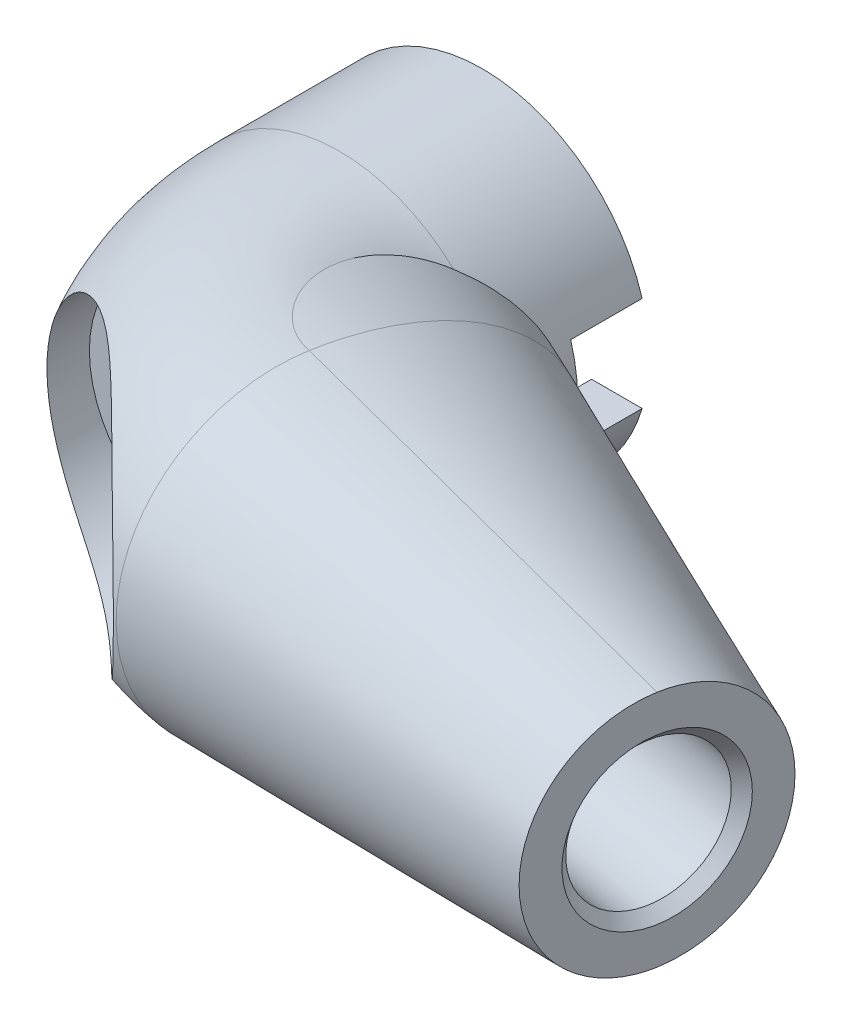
ISO-10303-21;
HEADER;
FILE_DESCRIPTION(('STEP AP214'),'2;1');
FILE_NAME('part.step','',(''),(''),'','','');
FILE_SCHEMA(('AUTOMOTIVE_DESIGN { 1 0 10303 214 1 1 1 1 }'));
ENDSEC;
DATA;
#1=APPLICATION_CONTEXT('core data for automotive mechanical design processes');
#2=APPLICATION_PROTOCOL_DEFINITION('international standard','automotive_design',2000,#1);
#3=PRODUCT_CONTEXT('',#1,'mechanical');
#4=PRODUCT('Part','Part','',(#3));
#5=PRODUCT_RELATED_PRODUCT_CATEGORY('part','',(#4));
#6=PRODUCT_DEFINITION_FORMATION('','',#4);
#7=PRODUCT_DEFINITION_CONTEXT('part definition',#1,'design');
#8=PRODUCT_DEFINITION('design','',#6,#7);
#9=PRODUCT_DEFINITION_SHAPE('','',#8);
#10=(LENGTH_UNIT() NAMED_UNIT(*) SI_UNIT(.MILLI.,.METRE.));
#11=(NAMED_UNIT(*) PLANE_ANGLE_UNIT() SI_UNIT($,.RADIAN.));
#12=(NAMED_UNIT(*) SI_UNIT($,.STERADIAN.) SOLID_ANGLE_UNIT());
#13=UNCERTAINTY_MEASURE_WITH_UNIT(LENGTH_MEASURE(1.E-05),#10,'distance_accuracy_value','');
#14=(GEOMETRIC_REPRESENTATION_CONTEXT(3) GLOBAL_UNCERTAINTY_ASSIGNED_CONTEXT((#13)) GLOBAL_UNIT_ASSIGNED_CONTEXT((#10,
#11,#12)) REPRESENTATION_CONTEXT('',''));
#15=CARTESIAN_POINT('',(0.,0.,0.));
#16=DIRECTION('',(0.,0.,1.));
#17=DIRECTION('',(1.,0.,0.));
#18=AXIS2_PLACEMENT_3D('',#15,#16,#17);
#19=CARTESIAN_POINT('',(23.3916039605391,-8.89566198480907E-12,18.9281679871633));
#20=DIRECTION('',(-0.984807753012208,0.,-0.173648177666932));
#21=DIRECTION('',(0.173648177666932,0.,-0.984807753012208));
#22=AXIS2_PLACEMENT_3D('',#19,#20,#21);
#23=PLANE('',#22);
#24=CARTESIAN_POINT('',(24.2605729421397,0.,14.));
#25=DIRECTION('',(-0.984807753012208,0.,-0.173648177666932));
#26=DIRECTION('',(-0.173648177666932,0.,0.984807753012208));
#27=AXIS2_PLACEMENT_3D('',#24,#25,#26);
#28=CIRCLE('',#27,3.44999999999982);
#29=CARTESIAN_POINT('',(24.8596591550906,0.,10.602413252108));
#30=VERTEX_POINT('',#29);
#31=EDGE_CURVE('E9',#30,#30,#28,.T.);
#32=ORIENTED_EDGE('',*,*,#31,.T.);
#33=EDGE_LOOP('',(#32));
#34=FACE_BOUND('',#33,.T.);
#35=CARTESIAN_POINT('',(24.2598448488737,4.99999999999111,14.0041292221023));
#36=CARTESIAN_POINT('',(24.1461923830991,4.99999999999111,14.6486843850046));
#37=CARTESIAN_POINT('',(23.91892535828,4.73995003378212,15.9375797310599));
#38=CARTESIAN_POINT('',(23.6299083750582,3.627659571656,17.5766764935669));
#39=CARTESIAN_POINT('',(23.4367611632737,1.96327709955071,18.6720687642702));
#40=CARTESIAN_POINT('',(23.3916039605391,0.654498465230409,18.9281679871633));
#41=CARTESIAN_POINT('',(23.3916039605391,-0.6544984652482,18.9281679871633));
#42=CARTESIAN_POINT('',(23.4367611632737,-1.96327709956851,18.6720687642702));
#43=CARTESIAN_POINT('',(23.6299083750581,-3.62765957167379,17.5766764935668));
#44=CARTESIAN_POINT('',(23.9189253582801,-4.73995003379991,15.9375797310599));
#45=CARTESIAN_POINT('',(24.1461923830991,-5.0000000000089,14.6486843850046));
#46=CARTESIAN_POINT('',(24.2598448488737,-5.0000000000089,14.0041292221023));
#47=B_SPLINE_CURVE_WITH_KNOTS('',3,(#35,#36,#37,#38,#39,#40,#41,#42,#43,#44,#45,#46),
.UNSPECIFIED.,.F.,.F.,(4,1,1,1,2,1,1,1,4),(0.,0.125,0.25,0.375,0.5,0.625,0.75,0.875,1.),.UNSPECIFIED.);
#48=CARTESIAN_POINT('',(24.2598448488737,4.9999999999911,14.0041292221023));
#49=VERTEX_POINT('',#48);
#50=CARTESIAN_POINT('',(24.2598448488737,-5.0000000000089,14.0041292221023));
#51=VERTEX_POINT('',#50);
#52=EDGE_CURVE('E132',#49,#51,#47,.T.);
#53=ORIENTED_EDGE('',*,*,#52,.T.);
#54=CARTESIAN_POINT('',(24.2598448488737,-5.00000000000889,14.0041292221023));
#55=CARTESIAN_POINT('',(24.3734974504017,-5.00000000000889,13.3595732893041));
#56=CARTESIAN_POINT('',(24.543947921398,-4.80496202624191,12.3929006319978));
#57=CARTESIAN_POINT('',(24.7452732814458,-4.18380311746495,11.251127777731));
#58=CARTESIAN_POINT('',(24.8777980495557,-3.558645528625,10.4995424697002));
#59=CARTESIAN_POINT('',(24.9863552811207,-2.79546526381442,9.88388381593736));
#60=CARTESIAN_POINT('',(25.0672523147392,-1.92592591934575,9.42509393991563));
#61=CARTESIAN_POINT('',(25.1167964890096,-0.981691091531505,9.14411496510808));
#62=CARTESIAN_POINT('',(25.1280857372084,-0.327248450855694,9.08009045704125));
#63=CARTESIAN_POINT('',(25.1280857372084,0.32725001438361,9.08009045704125));
#64=CARTESIAN_POINT('',(25.1167963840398,0.981695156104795,9.14411556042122));
#65=CARTESIAN_POINT('',(25.0672519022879,1.92593190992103,9.42509627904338));
#66=CARTESIAN_POINT('',(24.9863545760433,2.79547140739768,9.88388781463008));
#67=CARTESIAN_POINT('',(24.8777971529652,3.55865061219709,10.4995475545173));
#68=CARTESIAN_POINT('',(24.7452723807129,4.18380648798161,11.2511328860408));
#69=CARTESIAN_POINT('',(24.5439472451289,4.80496302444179,12.3929044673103));
#70=CARTESIAN_POINT('',(24.3734971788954,4.9999999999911,13.3595748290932));
#71=CARTESIAN_POINT('',(24.2598448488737,4.9999999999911,14.0041292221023));
#72=B_SPLINE_CURVE_WITH_KNOTS('',3,(#54,#55,#56,#57,#58,#59,#60,#61,#62,#63,#64,#65,#66,#67,#68,
#69,#70,#71),.UNSPECIFIED.,.F.,.F.,(4,1,1,1,1,1,1,2,1,1,1,1,1,1,4),(0.,0.124999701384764,
0.187499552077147,0.249999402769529,0.312499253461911,0.374999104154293,0.437498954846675,
0.499998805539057,0.562498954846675,0.624999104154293,0.687499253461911,0.749999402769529,
0.812499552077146,0.874999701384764,1.),.UNSPECIFIED.);
#73=EDGE_CURVE('E311',#49,#51,#72,.F.);
#74=ORIENTED_EDGE('',*,*,#73,.F.);
#75=EDGE_LOOP('',(#53,#74));
#76=FACE_BOUND('',#75,.T.);
#77=ADVANCED_FACE('F14',(#34,#76),#23,.F.);
#78=CARTESIAN_POINT('',(6.53330529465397,-7.0000000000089,10.8784620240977));
#79=CARTESIAN_POINT('',(12.4421518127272,-6.33333333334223,11.9203510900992));
#80=CARTESIAN_POINT('',(18.3509983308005,-5.66666666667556,12.9622401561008));
#81=CARTESIAN_POINT('',(24.2598448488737,-5.00000000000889,14.0041292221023));
#82=CARTESIAN_POINT('',(6.72802143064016,-7.0000000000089,9.77417194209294));
#83=CARTESIAN_POINT('',(12.6098467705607,-6.33333333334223,10.9693057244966));
#84=CARTESIAN_POINT('',(18.4916721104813,-5.66666666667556,12.1644395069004));
#85=CARTESIAN_POINT('',(24.3734974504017,-5.00000000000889,13.3595732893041));
#86=CARTESIAN_POINT('',(7.02024565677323,-6.80381386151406,8.11688600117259));
#87=CARTESIAN_POINT('',(12.8614797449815,-6.13752991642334,9.54222421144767));
#88=CARTESIAN_POINT('',(18.7027138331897,-5.47124597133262,10.9675624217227));
#89=CARTESIAN_POINT('',(24.543947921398,-4.80496202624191,12.3929006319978));
#90=CARTESIAN_POINT('',(7.39247169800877,-6.12661819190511,6.00588722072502));
#91=CARTESIAN_POINT('',(13.1767388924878,-5.47901316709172,7.754300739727));
#92=CARTESIAN_POINT('',(18.9610060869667,-4.83140814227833,9.50271425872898));
#93=CARTESIAN_POINT('',(24.7452732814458,-4.18380311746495,11.251127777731));
#94=CARTESIAN_POINT('',(7.65626707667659,-5.39363073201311,4.50982928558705));
#95=CARTESIAN_POINT('',(13.3967774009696,-4.7819689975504,6.50640034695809));
#96=CARTESIAN_POINT('',(19.1372877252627,-4.1703072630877,8.50297140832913));
#97=CARTESIAN_POINT('',(24.8777980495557,-3.558645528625,10.4995424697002));
#98=CARTESIAN_POINT('',(7.89563722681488,-4.41730747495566,3.15229370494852));
#99=CARTESIAN_POINT('',(13.5925432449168,-3.87669340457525,5.39615707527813));
#100=CARTESIAN_POINT('',(19.2894492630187,-3.33607933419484,7.64002044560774));
#101=CARTESIAN_POINT('',(24.9863552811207,-2.79546526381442,9.88388381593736));
#102=CARTESIAN_POINT('',(8.09594007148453,-3.17868299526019,2.01631982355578));
#103=CARTESIAN_POINT('',(13.7530441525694,-2.76109730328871,4.48591119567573));
#104=CARTESIAN_POINT('',(19.4101482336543,-2.34351161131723,6.95550256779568));
#105=CARTESIAN_POINT('',(25.0672523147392,-1.92592591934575,9.42509393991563));
#106=CARTESIAN_POINT('',(8.23559422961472,-1.68089481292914,1.22430173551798));
#107=CARTESIAN_POINT('',(13.862661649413,-1.4478269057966,3.86423947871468));
#108=CARTESIAN_POINT('',(19.4897290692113,-1.21475899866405,6.50417722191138));
#109=CARTESIAN_POINT('',(25.1167964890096,-0.981691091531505,9.14411496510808));
#110=CARTESIAN_POINT('',(8.26978707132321,-0.560664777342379,1.03038449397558));
#111=CARTESIAN_POINT('',(13.8892199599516,-0.482859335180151,3.71361981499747));
#112=CARTESIAN_POINT('',(19.5086528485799,-0.405053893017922,6.39685513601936));
#113=CARTESIAN_POINT('',(25.1280857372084,-0.327248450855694,9.08009045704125));
#114=CARTESIAN_POINT('',(8.26978707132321,0.56066209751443,1.03038449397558));
#115=CARTESIAN_POINT('',(13.8892199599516,0.482858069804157,3.71361981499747));
#116=CARTESIAN_POINT('',(19.5086528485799,0.405054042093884,6.39685513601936));
#117=CARTESIAN_POINT('',(25.1280857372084,0.32725001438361,9.08009045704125));
#118=CARTESIAN_POINT('',(8.23559455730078,1.68088786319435,1.2242998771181));
#119=CARTESIAN_POINT('',(13.8626618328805,1.44782362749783,3.86423843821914));
#120=CARTESIAN_POINT('',(19.4897291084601,1.21475939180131,6.50417699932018));
#121=CARTESIAN_POINT('',(25.1167963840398,0.981695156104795,9.14411556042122));
#122=CARTESIAN_POINT('',(8.09594117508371,3.1786739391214,2.01631356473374));
#123=CARTESIAN_POINT('',(13.7530447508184,2.76109326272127,4.48590780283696));
#124=CARTESIAN_POINT('',(19.4101483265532,2.34351258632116,6.95550204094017));
#125=CARTESIAN_POINT('',(25.0672519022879,1.92593190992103,9.42509627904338));
#126=CARTESIAN_POINT('',(7.89563888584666,4.41729919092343,3.15228429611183));
#127=CARTESIAN_POINT('',(13.5925441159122,3.87668992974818,5.39615213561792));
#128=CARTESIAN_POINT('',(19.2894493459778,3.33608066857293,7.640019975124));
#129=CARTESIAN_POINT('',(24.9863545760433,2.79547140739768,9.88388781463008));
#130=CARTESIAN_POINT('',(7.65626893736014,5.3936245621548,4.50981873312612));
#131=CARTESIAN_POINT('',(13.3967783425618,4.78196657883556,6.50639500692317));
#132=CARTESIAN_POINT('',(19.1372877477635,4.17030859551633,8.50297128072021));
#133=CARTESIAN_POINT('',(24.8777971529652,3.55865061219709,10.4995475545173));
#134=CARTESIAN_POINT('',(7.39247341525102,6.12661441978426,6.00587748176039));
#135=CARTESIAN_POINT('',(13.1767397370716,5.47901177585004,7.75429594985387));
#136=CARTESIAN_POINT('',(18.9610060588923,4.83140913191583,9.50271441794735));
#137=CARTESIAN_POINT('',(24.7452723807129,4.18380648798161,11.2511328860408));
#138=CARTESIAN_POINT('',(7.02024681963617,6.80381287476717,8.11687940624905));
#139=CARTESIAN_POINT('',(12.8614802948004,6.13752959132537,9.54222109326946));
#140=CARTESIAN_POINT('',(18.7027137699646,5.47124630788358,10.9675627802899));
#141=CARTESIAN_POINT('',(24.5439472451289,4.80496302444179,12.3929044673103));
#142=CARTESIAN_POINT('',(6.72802189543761,6.9999999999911,9.77416930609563));
#143=CARTESIAN_POINT('',(12.6098469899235,6.33333333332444,10.9693044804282));
#144=CARTESIAN_POINT('',(18.4916720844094,5.66666666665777,12.1644396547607));
#145=CARTESIAN_POINT('',(24.3734971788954,4.9999999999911,13.3595748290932));
#146=CARTESIAN_POINT('',(6.53330529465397,6.99999999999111,10.8784620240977));
#147=CARTESIAN_POINT('',(12.4421518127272,6.33333333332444,11.9203510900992));
#148=CARTESIAN_POINT('',(18.3509983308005,5.66666666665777,12.9622401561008));
#149=CARTESIAN_POINT('',(24.2598448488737,4.9999999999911,14.0041292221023));
#150=B_SPLINE_SURFACE_WITH_KNOTS('',3,3,((#78,#79,#80,#81),(#82,#83,#84,#85),(#86,#87,#88,#89),
(#90,#91,#92,#93),(#94,#95,#96,#97),(#98,#99,#100,#101),(#102,#103,#104,#105),(#106,#107,#108,
#109),(#110,#111,#112,#113),(#114,#115,#116,#117),(#118,#119,#120,#121),(#122,#123,#124,#125),
(#126,#127,#128,#129),(#130,#131,#132,#133),(#134,#135,#136,#137),(#138,#139,#140,#141),(#142,
#143,#144,#145),(#146,#147,#148,#149)),.UNSPECIFIED.,.F.,.F.,.F.,(4,1,1,1,1,1,1,2,1,1,1,1,1,1,
4),(4,4),(0.,0.124999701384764,0.187499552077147,0.249999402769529,0.312499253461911,
0.374999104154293,0.437498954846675,0.499998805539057,0.562498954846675,0.624999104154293,
0.687499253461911,0.749999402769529,0.812499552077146,0.874999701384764,1.),(0.,1.),.UNSPECIFIED.);
#151=CARTESIAN_POINT('',(6.53330529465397,-7.0000000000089,10.8784620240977));
#152=CARTESIAN_POINT('',(6.72802143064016,-7.0000000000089,9.77417194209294));
#153=CARTESIAN_POINT('',(7.02024565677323,-6.80381386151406,8.11688600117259));
#154=CARTESIAN_POINT('',(7.39247169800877,-6.12661819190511,6.00588722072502));
#155=CARTESIAN_POINT('',(7.65626707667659,-5.39363073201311,4.50982928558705));
#156=CARTESIAN_POINT('',(7.89563722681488,-4.41730747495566,3.15229370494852));
#157=CARTESIAN_POINT('',(8.09594007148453,-3.17868299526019,2.01631982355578));
#158=CARTESIAN_POINT('',(8.23559422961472,-1.68089481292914,1.22430173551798));
#159=CARTESIAN_POINT('',(8.26978707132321,-0.560664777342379,1.03038449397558));
#160=CARTESIAN_POINT('',(8.26978707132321,0.56066209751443,1.03038449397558));
#161=CARTESIAN_POINT('',(8.23559455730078,1.68088786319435,1.2242998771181));
#162=CARTESIAN_POINT('',(8.09594117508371,3.1786739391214,2.01631356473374));
#163=CARTESIAN_POINT('',(7.89563888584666,4.41729919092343,3.15228429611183));
#164=CARTESIAN_POINT('',(7.65626893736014,5.3936245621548,4.50981873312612));
#165=CARTESIAN_POINT('',(7.39247341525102,6.12661441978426,6.00587748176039));
#166=CARTESIAN_POINT('',(7.02024681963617,6.80381287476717,8.11687940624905));
#167=CARTESIAN_POINT('',(6.72802189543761,6.9999999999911,9.77416930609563));
#168=CARTESIAN_POINT('',(6.53330529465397,6.99999999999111,10.8784620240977));
#169=B_SPLINE_CURVE_WITH_KNOTS('',3,(#151,#152,#153,#154,#155,#156,#157,#158,#159,#160,#161,
#162,#163,#164,#165,#166,#167,#168),.UNSPECIFIED.,.F.,.F.,(4,1,1,1,1,1,1,2,1,1,1,1,1,1,4),(0.,
0.124999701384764,0.187499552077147,0.249999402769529,0.312499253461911,0.374999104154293,
0.437498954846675,0.499998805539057,0.562498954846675,0.624999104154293,0.687499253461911,
0.749999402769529,0.812499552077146,0.874999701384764,1.),.UNSPECIFIED.);
#170=CARTESIAN_POINT('',(6.53331233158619,-7.00000000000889,10.8784632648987));
#171=VERTEX_POINT('',#170);
#172=CARTESIAN_POINT('',(6.53331221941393,6.9999999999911,10.8784632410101));
#173=VERTEX_POINT('',#172);
#174=EDGE_CURVE('E227',#171,#173,#169,.T.);
#175=DIRECTION('',(0.978784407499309,-0.110431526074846,0.17258609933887));
#176=VECTOR('',#175,1.);
#177=CARTESIAN_POINT('',(15.3965750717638,5.9999999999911,12.4412956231));
#178=LINE('',#177,#176);
#179=EDGE_CURVE('E305',#173,#49,#178,.T.);
#180=DIRECTION('',(-0.978784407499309,-0.110431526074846,-0.17258609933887));
#181=VECTOR('',#180,1.);
#182=CARTESIAN_POINT('',(15.3965750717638,-6.00000000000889,12.4412956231));
#183=LINE('',#182,#181);
#184=EDGE_CURVE('E137',#51,#171,#183,.T.);
#185=ORIENTED_EDGE('',*,*,#174,.T.);
#186=ORIENTED_EDGE('',*,*,#179,.T.);
#187=ORIENTED_EDGE('',*,*,#73,.T.);
#188=ORIENTED_EDGE('',*,*,#184,.T.);
#189=EDGE_LOOP('',(#185,#186,#187,#188));
#190=FACE_BOUND('',#189,.T.);
#191=ADVANCED_FACE('F185',(#190),#150,.T.);
#192=CARTESIAN_POINT('',(24.2598448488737,4.99999999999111,14.0041292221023));
#193=CARTESIAN_POINT('',(18.3509983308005,5.66666666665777,12.9622401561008));
#194=CARTESIAN_POINT('',(12.4421518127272,6.33333333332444,11.9203510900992));
#195=CARTESIAN_POINT('',(6.53330529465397,6.9999999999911,10.8784620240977));
#196=CARTESIAN_POINT('',(24.1461923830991,4.99999999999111,14.6486843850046));
#197=CARTESIAN_POINT('',(18.2221922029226,5.66666666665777,13.69273600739));
#198=CARTESIAN_POINT('',(12.2981920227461,6.33333333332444,12.7367876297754));
#199=CARTESIAN_POINT('',(6.37419184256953,6.9999999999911,11.7808392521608));
#200=CARTESIAN_POINT('',(23.91892535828,4.73995003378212,15.9375797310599));
#201=CARTESIAN_POINT('',(17.9646229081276,5.37194337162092,15.1534840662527));
#202=CARTESIAN_POINT('',(12.0103204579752,6.00393670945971,14.3693884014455));
#203=CARTESIAN_POINT('',(6.05601800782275,6.63593004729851,13.5852927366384));
#204=CARTESIAN_POINT('',(23.6299083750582,3.627659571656,17.5766764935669));
#205=CARTESIAN_POINT('',(17.6370703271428,4.11134751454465,17.0111270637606));
#206=CARTESIAN_POINT('',(11.6442322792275,4.59503545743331,16.4455776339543));
#207=CARTESIAN_POINT('',(5.65139423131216,5.07872340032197,15.8800282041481));
#208=CARTESIAN_POINT('',(23.4367611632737,1.96327709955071,18.6720687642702));
#209=CARTESIAN_POINT('',(17.418170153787,2.22504737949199,18.2525716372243));
#210=CARTESIAN_POINT('',(11.3995791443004,2.48681765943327,17.8330745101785));
#211=CARTESIAN_POINT('',(5.38098813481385,2.74858793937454,17.4135773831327));
#212=CARTESIAN_POINT('',(23.3916039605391,0.654498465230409,18.9281679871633));
#213=CARTESIAN_POINT('',(17.3669919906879,0.741764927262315,18.54281742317));
#214=CARTESIAN_POINT('',(11.3423800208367,0.829031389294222,18.1574668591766));
#215=CARTESIAN_POINT('',(5.31776805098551,0.916297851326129,17.7721162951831));
#216=CARTESIAN_POINT('',(23.3916039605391,-0.6544984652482,18.9281679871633));
#217=CARTESIAN_POINT('',(17.3669919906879,-0.741764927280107,18.54281742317));
#218=CARTESIAN_POINT('',(11.3423800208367,-0.829031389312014,18.1574668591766));
#219=CARTESIAN_POINT('',(5.31776805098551,-0.916297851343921,17.7721162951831));
#220=CARTESIAN_POINT('',(23.4367611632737,-1.96327709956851,18.6720687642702));
#221=CARTESIAN_POINT('',(17.418170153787,-2.22504737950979,18.2525716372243));
#222=CARTESIAN_POINT('',(11.3995791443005,-2.48681765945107,17.8330745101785));
#223=CARTESIAN_POINT('',(5.38098813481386,-2.74858793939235,17.4135773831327));
#224=CARTESIAN_POINT('',(23.6299083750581,-3.62765957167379,17.5766764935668));
#225=CARTESIAN_POINT('',(17.6370703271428,-4.11134751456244,17.0111270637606));
#226=CARTESIAN_POINT('',(11.6442322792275,-4.59503545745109,16.4455776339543));
#227=CARTESIAN_POINT('',(5.65139423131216,-5.07872340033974,15.8800282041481));
#228=CARTESIAN_POINT('',(23.9189253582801,-4.73995003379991,15.9375797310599));
#229=CARTESIAN_POINT('',(17.9646229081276,-5.37194337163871,15.1534840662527));
#230=CARTESIAN_POINT('',(12.0103204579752,-6.00393670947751,14.3693884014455));
#231=CARTESIAN_POINT('',(6.05601800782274,-6.63593004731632,13.5852927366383));
#232=CARTESIAN_POINT('',(24.1461923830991,-5.0000000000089,14.6486843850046));
#233=CARTESIAN_POINT('',(18.2221922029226,-5.66666666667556,13.69273600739));
#234=CARTESIAN_POINT('',(12.2981920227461,-6.33333333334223,12.7367876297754));
#235=CARTESIAN_POINT('',(6.37419184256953,-7.00000000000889,11.7808392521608));
#236=CARTESIAN_POINT('',(24.2598448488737,-5.0000000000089,14.0041292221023));
#237=CARTESIAN_POINT('',(18.3509983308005,-5.66666666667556,12.9622401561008));
#238=CARTESIAN_POINT('',(12.4421518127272,-6.33333333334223,11.9203510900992));
#239=CARTESIAN_POINT('',(6.53330529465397,-7.00000000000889,10.8784620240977));
#240=B_SPLINE_SURFACE_WITH_KNOTS('',3,3,((#192,#193,#194,#195),(#196,#197,#198,#199),(#200,#201,
#202,#203),(#204,#205,#206,#207),(#208,#209,#210,#211),(#212,#213,#214,#215),(#216,#217,#218,
#219),(#220,#221,#222,#223),(#224,#225,#226,#227),(#228,#229,#230,#231),(#232,#233,#234,#235),
(#236,#237,#238,#239)),.UNSPECIFIED.,.F.,.F.,.F.,(4,1,1,1,2,1,1,1,4),(4,4),(0.,0.125,0.25,0.375,
0.5,0.625,0.75,0.875,1.),(0.,1.),.UNSPECIFIED.);
#241=CARTESIAN_POINT('',(6.53330529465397,6.9999999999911,10.8784620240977));
#242=CARTESIAN_POINT('',(6.37419184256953,6.9999999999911,11.7808392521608));
#243=CARTESIAN_POINT('',(6.05601800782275,6.63593004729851,13.5852927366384));
#244=CARTESIAN_POINT('',(5.65139423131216,5.07872340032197,15.8800282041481));
#245=CARTESIAN_POINT('',(5.38098813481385,2.74858793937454,17.4135773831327));
#246=CARTESIAN_POINT('',(5.31776805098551,0.916297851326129,17.7721162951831));
#247=CARTESIAN_POINT('',(5.31776805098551,-0.916297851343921,17.7721162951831));
#248=CARTESIAN_POINT('',(5.38098813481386,-2.74858793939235,17.4135773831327));
#249=CARTESIAN_POINT('',(5.65139423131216,-5.07872340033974,15.8800282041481));
#250=CARTESIAN_POINT('',(6.05601800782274,-6.63593004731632,13.5852927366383));
#251=CARTESIAN_POINT('',(6.37419184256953,-7.00000000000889,11.7808392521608));
#252=CARTESIAN_POINT('',(6.53330529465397,-7.00000000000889,10.8784620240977));
#253=B_SPLINE_CURVE_WITH_KNOTS('',3,(#241,#242,#243,#244,#245,#246,#247,#248,#249,#250,#251,
#252),.UNSPECIFIED.,.F.,.F.,(4,1,1,1,2,1,1,1,4),(0.,0.125,0.25,0.375,0.5,0.625,0.75,0.875,1.),.UNSPECIFIED.);
#254=EDGE_CURVE('E307',#171,#173,#253,.F.);
#255=ORIENTED_EDGE('',*,*,#52,.F.);
#256=ORIENTED_EDGE('',*,*,#179,.F.);
#257=ORIENTED_EDGE('',*,*,#254,.F.);
#258=ORIENTED_EDGE('',*,*,#184,.F.);
#259=EDGE_LOOP('',(#255,#256,#257,#258));
#260=FACE_BOUND('',#259,.T.);
#261=ADVANCED_FACE('F192',(#260),#240,.F.);
#262=CARTESIAN_POINT('',(6.59941344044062,-7.00000000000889,10.8901186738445));
#263=CARTESIAN_POINT('',(6.57737739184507,-7.00000000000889,10.8862331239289));
#264=CARTESIAN_POINT('',(6.55534134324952,-7.00000000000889,10.8823475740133));
#265=CARTESIAN_POINT('',(6.53330529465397,-7.00000000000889,10.8784620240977));
#266=CARTESIAN_POINT('',(5.91629593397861,-7.00000000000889,10.7696666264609));
#267=CARTESIAN_POINT('',(4.68227721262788,-7.0000000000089,10.5520758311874));
#268=CARTESIAN_POINT('',(2.96346542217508,-7.0000000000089,10.2490029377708));
#269=CARTESIAN_POINT('',(1.37686992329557,-7.00000000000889,9.96924334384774));
#270=CARTESIAN_POINT('',(0.407283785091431,-7.00000000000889,9.79827914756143));
#271=CARTESIAN_POINT('',(-0.077509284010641,-7.00000000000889,9.71279704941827));
#272=CARTESIAN_POINT('',(7.55601671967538,-7.00000000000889,5.46495188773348));
#273=CARTESIAN_POINT('',(7.53457636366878,-7.00000000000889,5.45768799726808));
#274=CARTESIAN_POINT('',(7.51313600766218,-7.00000000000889,5.45042410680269));
#275=CARTESIAN_POINT('',(7.49169565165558,-7.00000000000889,5.44316021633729));
#276=CARTESIAN_POINT('',(6.89136568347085,-7.00000000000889,5.23977128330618));
#277=CARTESIAN_POINT('',(5.69070574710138,-7.0000000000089,4.83299341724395));
#278=CARTESIAN_POINT('',(4.01835797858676,-7.0000000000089,4.26640996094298));
#279=CARTESIAN_POINT('',(2.47465234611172,-7.00000000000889,3.7434098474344));
#280=CARTESIAN_POINT('',(1.53127668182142,-7.00000000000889,3.42379866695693));
#281=CARTESIAN_POINT('',(1.05958884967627,-7.00000000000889,3.2639930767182));
#282=CARTESIAN_POINT('',(8.33265725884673,-3.86340506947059,1.06040451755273));
#283=CARTESIAN_POINT('',(8.31170052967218,-3.86340506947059,1.05039784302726));
#284=CARTESIAN_POINT('',(8.29074380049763,-3.86340506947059,1.04039116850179));
#285=CARTESIAN_POINT('',(8.26978707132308,-3.86340506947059,1.03038449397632));
#286=CARTESIAN_POINT('',(7.68299865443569,-3.86340506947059,0.750197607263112));
#287=CARTESIAN_POINT('',(6.50942182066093,-3.86340506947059,0.189823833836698));
#288=CARTESIAN_POINT('',(4.87479694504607,-3.86340506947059,-0.590696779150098));
#289=CARTESIAN_POINT('',(3.36591244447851,-3.86340506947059,-1.31117734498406));
#290=CARTESIAN_POINT('',(2.44381636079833,-3.86340506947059,-1.75147102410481));
#291=CARTESIAN_POINT('',(1.98276831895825,-3.86340506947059,-1.97161786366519));
#292=CARTESIAN_POINT('',(8.33265725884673,3.8634050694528,1.06040451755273));
#293=CARTESIAN_POINT('',(8.31170052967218,3.8634050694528,1.05039784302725));
#294=CARTESIAN_POINT('',(8.29074380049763,3.8634050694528,1.04039116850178));
#295=CARTESIAN_POINT('',(8.26978707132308,3.8634050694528,1.03038449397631));
#296=CARTESIAN_POINT('',(7.68299865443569,3.8634050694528,0.750197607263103));
#297=CARTESIAN_POINT('',(6.50942182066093,3.86340506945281,0.189823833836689));
#298=CARTESIAN_POINT('',(4.87479694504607,3.86340506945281,-0.590696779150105));
#299=CARTESIAN_POINT('',(3.36591244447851,3.8634050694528,-1.31117734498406));
#300=CARTESIAN_POINT('',(2.44381636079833,3.8634050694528,-1.75147102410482));
#301=CARTESIAN_POINT('',(1.98276831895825,3.8634050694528,-1.9716178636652));
#302=CARTESIAN_POINT('',(7.55601671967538,6.9999999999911,5.46495188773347));
#303=CARTESIAN_POINT('',(7.53457636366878,6.9999999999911,5.45768799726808));
#304=CARTESIAN_POINT('',(7.51313600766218,6.9999999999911,5.45042410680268));
#305=CARTESIAN_POINT('',(7.49169565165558,6.9999999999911,5.44316021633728));
#306=CARTESIAN_POINT('',(6.89136568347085,6.9999999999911,5.23977128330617));
#307=CARTESIAN_POINT('',(5.69070574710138,6.9999999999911,4.83299341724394));
#308=CARTESIAN_POINT('',(4.01835797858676,6.9999999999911,4.26640996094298));
#309=CARTESIAN_POINT('',(2.47465234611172,6.9999999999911,3.74340984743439));
#310=CARTESIAN_POINT('',(1.53127668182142,6.9999999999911,3.42379866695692));
#311=CARTESIAN_POINT('',(1.05958884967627,6.9999999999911,3.26399307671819));
#312=CARTESIAN_POINT('',(6.59941344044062,6.9999999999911,10.8901186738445));
#313=CARTESIAN_POINT('',(6.57737739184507,6.9999999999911,10.8862331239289));
#314=CARTESIAN_POINT('',(6.55534134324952,6.9999999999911,10.8823475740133));
#315=CARTESIAN_POINT('',(6.53330529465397,6.9999999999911,10.8784620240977));
#316=CARTESIAN_POINT('',(5.91629593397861,6.9999999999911,10.7696666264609));
#317=CARTESIAN_POINT('',(4.68227721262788,6.9999999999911,10.5520758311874));
#318=CARTESIAN_POINT('',(2.96346542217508,6.9999999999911,10.2490029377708));
#319=CARTESIAN_POINT('',(1.37686992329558,6.9999999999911,9.96924334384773));
#320=CARTESIAN_POINT('',(0.407283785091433,6.9999999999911,9.79827914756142));
#321=CARTESIAN_POINT('',(-0.0775092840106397,6.9999999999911,9.71279704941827));
#322=B_SPLINE_SURFACE_WITH_KNOTS('',3,3,((#262,#263,#264,#265,#266,#267,#268,#269,#270,#271),
(#272,#273,#274,#275,#276,#277,#278,#279,#280,#281),(#282,#283,#284,#285,#286,#287,#288,#289,
#290,#291),(#292,#293,#294,#295,#296,#297,#298,#299,#300,#301),(#302,#303,#304,#305,#306,#307,
#308,#309,#310,#311),(#312,#313,#314,#315,#316,#317,#318,#319,#320,#321)),.UNSPECIFIED.,.F.,.F.,
.F.,(4,2,4),(4,3,1,1,1,4),(0.,0.5,1.),(-0.01,0.,0.28,0.56,0.78,1.),.UNSPECIFIED.);
#323=CARTESIAN_POINT('',(4.71408566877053,5.10300086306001,2.99999999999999));
#324=CARTESIAN_POINT('',(4.66864064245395,5.14567326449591,3.05696039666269));
#325=CARTESIAN_POINT('',(4.62424396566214,5.18764755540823,3.11527993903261));
#326=CARTESIAN_POINT('',(4.53807145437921,5.26977597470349,3.23395476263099));
#327=CARTESIAN_POINT('',(4.4962748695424,5.30994352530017,3.2942856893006));
#328=CARTESIAN_POINT('',(4.41532967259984,5.38848711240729,3.41682855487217));
#329=CARTESIAN_POINT('',(4.37616073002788,5.42687595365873,3.47901885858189));
#330=CARTESIAN_POINT('',(4.30049668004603,5.50189374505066,3.60512697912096));
#331=CARTESIAN_POINT('',(4.2639816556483,5.53853489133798,3.66902559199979));
#332=CARTESIAN_POINT('',(4.19365103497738,5.61008967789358,3.79840043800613));
#333=CARTESIAN_POINT('',(4.15981591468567,5.64501493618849,3.86385963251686));
#334=CARTESIAN_POINT('',(4.09487017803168,5.71317157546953,3.9962088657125));
#335=CARTESIAN_POINT('',(4.06374041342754,5.74641402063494,4.06308381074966));
#336=CARTESIAN_POINT('',(4.00422982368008,5.81123968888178,4.19812109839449));
#337=CARTESIAN_POINT('',(3.97583021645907,5.84283344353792,4.26627010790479));
#338=CARTESIAN_POINT('',(3.92180431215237,5.90439735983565,4.40371557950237));
#339=CARTESIAN_POINT('',(3.89615959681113,5.9343775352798,4.47300031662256));
#340=CARTESIAN_POINT('',(3.84766545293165,5.99275089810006,4.61258039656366));
#341=CARTESIAN_POINT('',(3.82479799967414,6.02115358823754,4.68286550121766));
#342=CARTESIAN_POINT('',(3.78188641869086,6.07640921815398,4.82431447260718));
#343=CARTESIAN_POINT('',(3.76182465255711,6.10327114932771,4.89546947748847));
#344=CARTESIAN_POINT('',(3.72347560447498,6.15695615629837,5.04255786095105));
#345=CARTESIAN_POINT('',(3.70532681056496,6.18371041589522,5.11855251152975));
#346=CARTESIAN_POINT('',(3.67215635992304,6.23561248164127,5.27132126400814));
#347=CARTESIAN_POINT('',(3.65711952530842,6.26076764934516,5.34808957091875));
#348=CARTESIAN_POINT('',(3.63020165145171,6.30951357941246,5.50226889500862));
#349=CARTESIAN_POINT('',(3.61830636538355,6.33311102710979,5.57967530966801));
#350=CARTESIAN_POINT('',(3.59769266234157,6.37878430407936,5.73499609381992));
#351=CARTESIAN_POINT('',(3.58896109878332,6.40086611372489,5.81290695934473));
#352=CARTESIAN_POINT('',(3.5746968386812,6.4435516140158,5.96910675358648));
#353=CARTESIAN_POINT('',(3.56915225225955,6.46416054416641,6.04739316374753));
#354=CARTESIAN_POINT('',(3.56128255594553,6.50394441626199,6.20421832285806));
#355=CARTESIAN_POINT('',(3.55894700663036,6.5231238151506,6.28275541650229));
#356=CARTESIAN_POINT('',(3.55751517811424,6.5600933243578,6.4399606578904));
#357=CARTESIAN_POINT('',(3.55841012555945,6.5778870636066,6.51862787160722));
#358=CARTESIAN_POINT('',(3.56345805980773,6.61213045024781,6.67597647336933));
#359=CARTESIAN_POINT('',(3.56760417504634,6.62858285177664,6.75465748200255));
#360=CARTESIAN_POINT('',(3.57917226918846,6.6601891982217,6.91192141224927));
#361=CARTESIAN_POINT('',(3.58658952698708,6.67534497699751,6.99050431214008));
#362=CARTESIAN_POINT('',(3.60471654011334,6.70440405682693,7.14746396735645));
#363=CARTESIAN_POINT('',(3.61542398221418,6.71830822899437,7.22584082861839));
#364=CARTESIAN_POINT('',(3.64043157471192,6.74521596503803,7.38408311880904));
#365=CARTESIAN_POINT('',(3.65480891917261,6.75819134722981,7.46394116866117));
#366=CARTESIAN_POINT('',(3.6870070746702,6.78284564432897,7.62270456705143));
#367=CARTESIAN_POINT('',(3.70480892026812,6.79453116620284,7.70161273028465));
#368=CARTESIAN_POINT('',(3.74387197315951,6.81667469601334,7.85836992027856));
#369=CARTESIAN_POINT('',(3.76511772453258,6.82713784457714,7.9362220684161));
#370=CARTESIAN_POINT('',(3.81108087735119,6.84690526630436,8.09076890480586));
#371=CARTESIAN_POINT('',(3.83578692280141,6.85621314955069,8.16746650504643));
#372=CARTESIAN_POINT('',(3.88868825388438,6.87373763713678,8.31960949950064));
#373=CARTESIAN_POINT('',(3.91687679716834,6.88195628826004,8.39505700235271));
#374=CARTESIAN_POINT('',(3.97769389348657,6.89761857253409,8.54702718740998));
#375=CARTESIAN_POINT('',(4.01043467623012,6.90502947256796,8.62350840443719));
#376=CARTESIAN_POINT('',(4.07930459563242,6.918737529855,8.77393664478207));
#377=CARTESIAN_POINT('',(4.11538919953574,6.92504679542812,8.84790292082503));
#378=CARTESIAN_POINT('',(4.19095950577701,6.93665471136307,8.99322330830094));
#379=CARTESIAN_POINT('',(4.23040780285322,6.94196279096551,9.0645960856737));
#380=CARTESIAN_POINT('',(4.31270836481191,6.95166845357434,9.2046629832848));
#381=CARTESIAN_POINT('',(4.35553159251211,6.95607283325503,9.27337368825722));
#382=CARTESIAN_POINT('',(4.44458123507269,6.96406816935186,9.40807145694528));
#383=CARTESIAN_POINT('',(4.49078785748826,6.96766342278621,9.47407130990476));
#384=CARTESIAN_POINT('',(4.56358520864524,6.97257700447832,9.5722261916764));
#385=CARTESIAN_POINT('',(4.58887698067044,6.97415664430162,9.60533847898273));
#386=CARTESIAN_POINT('',(4.64019873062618,6.97712069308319,9.67051390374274));
#387=CARTESIAN_POINT('',(4.66621999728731,6.97850673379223,9.70258380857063));
#388=CARTESIAN_POINT('',(4.71899667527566,6.98109936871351,9.76567252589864));
#389=CARTESIAN_POINT('',(4.74574426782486,6.98230734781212,9.79669782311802));
#390=CARTESIAN_POINT('',(4.79997405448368,6.98455896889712,9.85769510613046));
#391=CARTESIAN_POINT('',(4.82744932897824,6.98560376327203,9.88767319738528));
#392=CARTESIAN_POINT('',(4.88313375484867,6.98754357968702,9.94657474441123));
#393=CARTESIAN_POINT('',(4.91133693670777,6.98843953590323,9.97550381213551));
#394=CARTESIAN_POINT('',(4.96974750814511,6.99013252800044,10.0335722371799));
#395=CARTESIAN_POINT('',(4.99999020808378,6.99092438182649,10.0626762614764));
#396=CARTESIAN_POINT('',(5.06106669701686,6.99236902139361,10.1195026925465));
#397=CARTESIAN_POINT('',(5.09188880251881,6.99302338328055,10.147237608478));
#398=CARTESIAN_POINT('',(5.15412252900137,6.9942097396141,10.201328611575));
#399=CARTESIAN_POINT('',(5.18552376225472,6.99474301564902,10.2276966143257));
#400=CARTESIAN_POINT('',(5.24891377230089,6.99570291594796,10.2790580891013));
#401=CARTESIAN_POINT('',(5.2808935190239,6.99613055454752,10.3040626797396));
#402=CARTESIAN_POINT('',(5.34543831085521,6.99689388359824,10.3527020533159));
#403=CARTESIAN_POINT('',(5.37799570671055,6.99723035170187,10.3763469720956));
#404=CARTESIAN_POINT('',(5.44555433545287,6.99784185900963,10.423574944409));
#405=CARTESIAN_POINT('',(5.48059724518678,6.99811309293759,10.4470985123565));
#406=CARTESIAN_POINT('',(5.55105491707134,6.99858054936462,10.4924066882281));
#407=CARTESIAN_POINT('',(5.58645635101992,6.99877782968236,10.5142119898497));
#408=CARTESIAN_POINT('',(5.65762725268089,6.99911233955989,10.5560942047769));
#409=CARTESIAN_POINT('',(5.69338533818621,6.99925034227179,10.5761904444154));
#410=CARTESIAN_POINT('',(5.76526698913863,6.99947963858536,10.6146674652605));
#411=CARTESIAN_POINT('',(5.80138110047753,6.99957146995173,10.6330658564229));
#412=CARTESIAN_POINT('',(5.85595731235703,6.99968321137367,10.6594508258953));
#413=CARTESIAN_POINT('',(5.87414347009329,6.99971604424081,10.6680119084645));
#414=CARTESIAN_POINT('',(5.91060375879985,6.99977428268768,10.6847131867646));
#415=CARTESIAN_POINT('',(5.92887706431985,6.99979972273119,10.6928551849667));
#416=CARTESIAN_POINT('',(5.9853242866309,6.99986851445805,10.717290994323));
#417=CARTESIAN_POINT('',(6.02377946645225,6.99990173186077,10.7329414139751));
#418=CARTESIAN_POINT('',(6.09131146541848,6.99994419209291,10.7586709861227));
#419=CARTESIAN_POINT('',(6.12023880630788,6.99995741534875,10.7691435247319));
#420=CARTESIAN_POINT('',(6.17819054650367,6.9999771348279,10.7889399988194));
#421=CARTESIAN_POINT('',(6.20721173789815,6.99998369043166,10.7982734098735));
#422=CARTESIAN_POINT('',(6.26333673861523,6.99999257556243,10.8154643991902));
#423=CARTESIAN_POINT('',(6.29042213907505,6.99999518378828,10.8233801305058));
#424=CARTESIAN_POINT('',(6.3399880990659,6.9999980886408,10.8364150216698));
#425=CARTESIAN_POINT('',(6.36240432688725,6.99999872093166,10.8417808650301));
#426=CARTESIAN_POINT('',(6.43424350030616,6.99999969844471,10.8580178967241));
#427=CARTESIAN_POINT('',(6.48393090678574,6.99999879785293,10.8678060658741));
#428=CARTESIAN_POINT('',(6.53331890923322,6.9999999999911,10.8784644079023));
#429=B_SPLINE_CURVE_WITH_KNOTS('',3,(#323,#324,#325,#326,#327,#328,#329,#330,#331,#332,#333,
#334,#335,#336,#337,#338,#339,#340,#341,#342,#343,#344,#345,#346,#347,#348,#349,#350,#351,#352,
#353,#354,#355,#356,#357,#358,#359,#360,#361,#362,#363,#364,#365,#366,#367,#368,#369,#370,#371,
#372,#373,#374,#375,#376,#377,#378,#379,#380,#381,#382,#383,#384,#385,#386,#387,#388,#389,#390,
#391,#392,#393,#394,#395,#396,#397,#398,#399,#400,#401,#402,#403,#404,#405,#406,#407,#408,#409,
#410,#411,#412,#413,#414,#415,#416,#417,#418,#419,#420,#421,#422,#423,#424,#425,#426,#427,#428),
.UNSPECIFIED.,.F.,.F.,(4,2,2,2,2,2,2,2,2,2,2,2,2,2,2,2,2,2,2,2,2,2,2,2,2,2,2,2,2,2,2,2,2,2,2,2,
2,2,2,2,2,2,2,2,2,2,2,2,2,2,2,2,4),(0.,0.25330929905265,0.504232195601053,0.752912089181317,
0.999475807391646,1.24403599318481,1.48669354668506,1.72754008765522,1.96666040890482,
2.2041348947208,2.44004199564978,2.68772006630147,2.93416008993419,3.17946254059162,
3.42373363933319,3.66708740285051,3.9096476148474,4.15154958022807,4.39294164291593,
4.63398644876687,4.87486216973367,5.12129559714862,5.3664016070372,5.61043660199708,
5.85368871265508,6.09647704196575,6.34694418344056,6.59445633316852,6.83950622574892,
7.08263947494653,7.3244493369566,7.44952366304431,7.57347035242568,7.6963954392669,
7.81840882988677,7.93962483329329,8.065540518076,8.18992279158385,8.3129198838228,
8.43468553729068,8.55537730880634,8.68196686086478,8.80666953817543,8.92969232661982,
9.05124698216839,9.11154461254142,9.17155646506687,9.29606497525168,9.38833923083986,
9.47978432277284,9.56440996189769,9.63354983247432,9.78530568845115),.UNSPECIFIED.);
#430=CARTESIAN_POINT('',(4.71407320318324,5.10299876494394,2.99999162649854));
#431=VERTEX_POINT('',#430);
#432=EDGE_CURVE('E282',#173,#431,#429,.F.);
#433=CARTESIAN_POINT('',(6.53331936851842,-7.00000000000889,10.8784645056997));
#434=CARTESIAN_POINT('',(6.50867000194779,-6.9999998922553,10.8729091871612));
#435=CARTESIAN_POINT('',(6.48392570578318,-6.99999986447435,10.867794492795));
#436=CARTESIAN_POINT('',(6.43438575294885,-6.99999964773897,10.8575551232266));
#437=CARTESIAN_POINT('',(6.40959009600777,-6.99999945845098,10.8524304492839));
#438=CARTESIAN_POINT('',(6.35730941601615,-6.99999854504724,10.8406464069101));
#439=CARTESIAN_POINT('',(6.32984793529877,-6.99999776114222,10.8338777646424));
#440=CARTESIAN_POINT('',(6.28039368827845,-6.99999417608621,10.8204104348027));
#441=CARTESIAN_POINT('',(6.25833878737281,-6.99999177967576,10.813935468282));
#442=CARTESIAN_POINT('',(6.17781244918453,-6.99997904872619,10.7892633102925));
#443=CARTESIAN_POINT('',(6.11981199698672,-6.99996214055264,10.7694889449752));
#444=CARTESIAN_POINT('',(6.02377494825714,-6.99990170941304,10.7329672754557));
#445=CARTESIAN_POINT('',(5.98532542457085,-6.99986851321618,10.7172965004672));
#446=CARTESIAN_POINT('',(5.92888017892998,-6.99979972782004,10.6928541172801));
#447=CARTESIAN_POINT('',(5.91060837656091,-6.9997742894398,10.6847145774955));
#448=CARTESIAN_POINT('',(5.87415190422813,-6.99971605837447,10.6680164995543));
#449=CARTESIAN_POINT('',(5.8559680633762,-6.9996832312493,10.6594561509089));
#450=CARTESIAN_POINT('',(5.80139491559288,-6.99957150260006,10.6330722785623));
#451=CARTESIAN_POINT('',(5.76528132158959,-6.99947967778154,10.6146747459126));
#452=CARTESIAN_POINT('',(5.69340085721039,-6.99925039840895,10.5761991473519));
#453=CARTESIAN_POINT('',(5.65764344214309,-6.99911240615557,10.5561034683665));
#454=CARTESIAN_POINT('',(5.58647028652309,-6.99877790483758,10.5142204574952));
#455=CARTESIAN_POINT('',(5.55106601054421,-6.99858061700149,10.4924136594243));
#456=CARTESIAN_POINT('',(5.48060272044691,-6.99811313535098,10.4471021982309));
#457=CARTESIAN_POINT('',(5.44555703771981,-6.99784188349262,10.4235768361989));
#458=CARTESIAN_POINT('',(5.37799958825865,-6.99723038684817,10.3763496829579));
#459=CARTESIAN_POINT('',(5.34544597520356,-6.99689396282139,10.3527076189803));
#460=CARTESIAN_POINT('',(5.28090861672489,-6.99613074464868,10.3040742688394));
#461=CARTESIAN_POINT('',(5.24893251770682,-6.99570317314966,10.2790728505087));
#462=CARTESIAN_POINT('',(5.18554653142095,-6.99474338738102,10.2277154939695));
#463=CARTESIAN_POINT('',(5.1541457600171,-6.99421014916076,10.2013483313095));
#464=CARTESIAN_POINT('',(5.0919129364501,-6.99302387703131,10.1472590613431));
#465=CARTESIAN_POINT('',(5.0610912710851,-6.99236956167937,10.1195250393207));
#466=CARTESIAN_POINT('',(5.00000660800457,-6.99092481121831,10.0626920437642));
#467=CARTESIAN_POINT('',(4.96975557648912,-6.99013276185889,10.0335802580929));
#468=CARTESIAN_POINT('',(4.91134588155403,-6.98843979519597,9.97551270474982));
#469=CARTESIAN_POINT('',(4.88315136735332,-6.98754413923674,9.94659281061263));
#470=CARTESIAN_POINT('',(4.82747564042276,-6.98560473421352,9.88770159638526));
#471=CARTESIAN_POINT('',(4.80000065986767,-6.98456000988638,9.85772441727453));
#472=CARTESIAN_POINT('',(4.74577143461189,-6.98230853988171,9.79672899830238));
#473=CARTESIAN_POINT('',(4.71902410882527,-6.98110064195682,9.76570465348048));
#474=CARTESIAN_POINT('',(4.66624277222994,-6.97850792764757,9.70261170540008));
#475=CARTESIAN_POINT('',(4.64021676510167,-6.97712169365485,9.67053646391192));
#476=CARTESIAN_POINT('',(4.58888578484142,-6.97415719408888,9.6053500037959));
#477=CARTESIAN_POINT('',(4.56358952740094,-6.97257729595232,9.57223201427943));
#478=CARTESIAN_POINT('',(4.49079811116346,-6.96766411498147,9.47408513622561));
#479=CARTESIAN_POINT('',(4.44460098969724,-6.96406970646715,9.40809967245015));
#480=CARTESIAN_POINT('',(4.35556022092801,-6.95607564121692,9.27341866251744));
#481=CARTESIAN_POINT('',(4.31273706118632,-6.95167153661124,9.20470987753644));
#482=CARTESIAN_POINT('',(4.23043651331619,-6.94196648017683,9.06464690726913));
#483=CARTESIAN_POINT('',(4.19098815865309,-6.93665873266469,8.9932761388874));
#484=CARTESIAN_POINT('',(4.11541761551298,-6.92505154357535,8.84795985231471));
#485=CARTESIAN_POINT('',(4.07933282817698,-6.91874267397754,8.77399566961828));
#486=CARTESIAN_POINT('',(4.01045230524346,-6.90503346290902,8.62354958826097));
#487=CARTESIAN_POINT('',(3.97770220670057,-6.89762071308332,8.54704795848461));
#488=CARTESIAN_POINT('',(3.91688606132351,-6.88195867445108,8.39508015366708));
#489=CARTESIAN_POINT('',(3.88870570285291,-6.8737427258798,8.31965621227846));
#490=CARTESIAN_POINT('',(3.83581090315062,-6.85622178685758,8.16753895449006));
#491=CARTESIAN_POINT('',(3.81110422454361,-6.84691443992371,8.09084321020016));
#492=CARTESIAN_POINT('',(3.76513968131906,-6.82714815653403,7.93630010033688));
#493=CARTESIAN_POINT('',(3.74389317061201,-6.81668561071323,7.8584498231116));
#494=CARTESIAN_POINT('',(3.70482847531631,-6.79454335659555,7.70169638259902));
#495=CARTESIAN_POINT('',(3.68702574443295,-6.78285850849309,7.62279009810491));
#496=CARTESIAN_POINT('',(3.6548194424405,-6.75820084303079,7.46399961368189));
#497=CARTESIAN_POINT('',(3.64043620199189,-6.74522094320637,7.38411239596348));
#498=CARTESIAN_POINT('',(3.61542899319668,-6.71831362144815,7.22587254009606));
#499=CARTESIAN_POINT('',(3.60472522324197,-6.70441533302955,7.14752752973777));
#500=CARTESIAN_POINT('',(3.58659939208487,-6.67536343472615,6.99060135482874));
#501=CARTESIAN_POINT('',(3.5791809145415,-6.66020847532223,6.91202002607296));
#502=CARTESIAN_POINT('',(3.56761026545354,-6.62860383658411,6.75475919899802));
#503=CARTESIAN_POINT('',(3.56346281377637,-6.61215232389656,6.67607972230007));
#504=CARTESIAN_POINT('',(3.55841209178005,-6.57791078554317,6.5187341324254));
#505=CARTESIAN_POINT('',(3.55751569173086,-6.56011800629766,6.44006839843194));
#506=CARTESIAN_POINT('',(3.55894450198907,-6.52315049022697,6.28286605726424));
#507=CARTESIAN_POINT('',(3.56127848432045,-6.50397212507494,6.20433038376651));
#508=CARTESIAN_POINT('',(3.56914493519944,-6.4641903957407,6.04750799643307));
#509=CARTESIAN_POINT('',(3.57468784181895,-6.44358257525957,5.9692229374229));
#510=CARTESIAN_POINT('',(3.58894863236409,-6.40089937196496,5.81302576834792));
#511=CARTESIAN_POINT('',(3.59767840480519,-6.3788187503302,5.73511617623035));
#512=CARTESIAN_POINT('',(3.6182884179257,-6.33314792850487,5.57979785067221));
#513=CARTESIAN_POINT('',(3.63018180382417,-6.3095517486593,5.50239262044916));
#514=CARTESIAN_POINT('',(3.65709576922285,-6.26080843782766,5.34821557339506));
#515=CARTESIAN_POINT('',(3.67213059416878,-6.23565462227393,5.27144835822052));
#516=CARTESIAN_POINT('',(3.70530656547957,-6.18374025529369,5.11863727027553));
#517=CARTESIAN_POINT('',(3.72346465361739,-6.15697148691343,5.04259986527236));
#518=CARTESIAN_POINT('',(3.76181343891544,-6.1032868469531,4.89551248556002));
#519=CARTESIAN_POINT('',(3.78186236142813,-6.0764414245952,4.82439978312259));
#520=CARTESIAN_POINT('',(3.82475744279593,-6.02120457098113,4.68299312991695));
#521=CARTESIAN_POINT('',(3.84762276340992,-5.99280337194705,4.6127088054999));
#522=CARTESIAN_POINT('',(3.89611254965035,-5.93443307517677,4.47313017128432));
#523=CARTESIAN_POINT('',(3.92175503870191,-5.90445447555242,4.40384609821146));
#524=CARTESIAN_POINT('',(3.9757764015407,-5.8428937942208,4.26640182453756));
#525=CARTESIAN_POINT('',(4.0041736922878,-5.81130169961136,4.19825334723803));
#526=CARTESIAN_POINT('',(4.06367956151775,-5.74647943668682,4.06321698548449));
#527=CARTESIAN_POINT('',(4.09480692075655,-5.71323873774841,3.99634243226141));
#528=CARTESIAN_POINT('',(4.15974776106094,-5.64508567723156,3.86399383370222));
#529=CARTESIAN_POINT('',(4.19358038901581,-5.61016225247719,3.79853487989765));
#530=CARTESIAN_POINT('',(4.26390594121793,-5.53861122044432,3.66916035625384));
#531=CARTESIAN_POINT('',(4.30041838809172,-5.5019719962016,3.60526182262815));
#532=CARTESIAN_POINT('',(4.37607720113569,-5.42695813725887,3.4791536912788));
#533=CARTESIAN_POINT('',(4.4152434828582,-5.38857130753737,3.41696329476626));
#534=CARTESIAN_POINT('',(4.49618327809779,-5.31003183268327,3.29442006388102));
#535=CARTESIAN_POINT('',(4.53797712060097,-5.26986638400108,3.23408886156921));
#536=CARTESIAN_POINT('',(4.62414406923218,-5.18774225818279,3.11541329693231));
#537=CARTESIAN_POINT('',(4.66853792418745,-5.14577016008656,3.0570932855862));
#538=CARTESIAN_POINT('',(4.71398011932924,-5.10309997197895,3.00013230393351));
#539=B_SPLINE_CURVE_WITH_KNOTS('',3,(#433,#434,#435,#436,#437,#438,#439,#440,#441,#442,#443,
#444,#445,#446,#447,#448,#449,#450,#451,#452,#453,#454,#455,#456,#457,#458,#459,#460,#461,#462,
#463,#464,#465,#466,#467,#468,#469,#470,#471,#472,#473,#474,#475,#476,#477,#478,#479,#480,#481,
#482,#483,#484,#485,#486,#487,#488,#489,#490,#491,#492,#493,#494,#495,#496,#497,#498,#499,#500,
#501,#502,#503,#504,#505,#506,#507,#508,#509,#510,#511,#512,#513,#514,#515,#516,#517,#518,#519,
#520,#521,#522,#523,#524,#525,#526,#527,#528,#529,#530,#531,#532,#533,#534,#535,#536,#537,#538),
.UNSPECIFIED.,.F.,.F.,(4,2,2,2,2,2,2,2,2,2,2,2,2,2,2,2,2,2,2,2,2,2,2,2,2,2,2,2,2,2,2,2,2,2,2,2,
2,2,2,2,2,2,2,2,2,2,2,2,2,2,2,2,4),(0.,0.0757996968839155,0.151756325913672,0.236569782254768,
0.305519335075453,0.489201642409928,0.61372013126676,0.673724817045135,0.734015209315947,
0.855567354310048,0.978587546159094,1.10329983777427,1.22989928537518,1.3505768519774,
1.47232803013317,1.59532243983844,1.71970193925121,1.84565176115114,1.96682991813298,
2.08884069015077,2.21176308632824,2.33573116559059,2.46082725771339,2.70258544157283,
2.94571365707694,3.19075830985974,3.43826499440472,3.68879955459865,3.93151274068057,
4.17475997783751,4.41878996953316,4.66389084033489,4.91041442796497,5.1511924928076,
5.39223255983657,5.63361979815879,5.87551685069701,6.11807205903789,6.36142072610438,
6.6056866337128,6.85098379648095,7.09741843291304,7.34523460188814,7.58100030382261,
7.81846925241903,8.05758392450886,8.29842469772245,8.5410763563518,8.7856305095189,
9.03218804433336,9.28086158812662,9.53177795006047,9.78508050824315),.UNSPECIFIED.);
#540=CARTESIAN_POINT('',(4.71403069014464,-5.10304859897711,3.00006215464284));
#541=VERTEX_POINT('',#540);
#542=EDGE_CURVE('E274',#541,#171,#539,.F.);
#543=CARTESIAN_POINT('',(4.71408566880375,5.10300086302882,2.99999999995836));
#544=CARTESIAN_POINT('',(4.83354497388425,4.99080094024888,2.85024955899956));
#545=CARTESIAN_POINT('',(4.95141752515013,4.87225242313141,2.70378901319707));
#546=CARTESIAN_POINT('',(5.18285015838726,4.62146071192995,2.41857111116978));
#547=CARTESIAN_POINT('',(5.29639864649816,4.48918381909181,2.27983405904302));
#548=CARTESIAN_POINT('',(5.51864363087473,4.20896358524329,2.01048254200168));
#549=CARTESIAN_POINT('',(5.62727306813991,4.06086400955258,1.87997413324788));
#550=CARTESIAN_POINT('',(5.836332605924,3.74987032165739,1.63080103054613));
#551=CARTESIAN_POINT('',(5.93677126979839,3.5869920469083,1.5121239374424));
#552=CARTESIAN_POINT('',(6.0974221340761,3.29972354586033,1.3237483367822));
#553=CARTESIAN_POINT('',(6.16037496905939,3.17927262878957,1.25035780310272));
#554=CARTESIAN_POINT('',(6.280585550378,2.93148107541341,1.1109406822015));
#555=CARTESIAN_POINT('',(6.33784488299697,2.80414237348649,1.04491204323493));
#556=CARTESIAN_POINT('',(6.44563919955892,2.54330088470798,0.921230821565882));
#557=CARTESIAN_POINT('',(6.49619596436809,2.40982006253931,0.863551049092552));
#558=CARTESIAN_POINT('',(6.58991224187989,2.13688883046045,0.757143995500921));
#559=CARTESIAN_POINT('',(6.63307535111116,1.99744136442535,0.70841236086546));
#560=CARTESIAN_POINT('',(6.71157624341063,1.71185877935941,0.620190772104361));
#561=CARTESIAN_POINT('',(6.74683171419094,1.5656708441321,0.580797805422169));
#562=CARTESIAN_POINT('',(6.80817792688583,1.26895902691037,0.512553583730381));
#563=CARTESIAN_POINT('',(6.8342687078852,1.1184351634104,0.483702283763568));
#564=CARTESIAN_POINT('',(6.87666835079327,0.81425067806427,0.437006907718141));
#565=CARTESIAN_POINT('',(6.89297265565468,0.660588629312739,0.419167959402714));
#566=CARTESIAN_POINT('',(6.91536798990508,0.351636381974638,0.3947539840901));
#567=CARTESIAN_POINT('',(6.92145972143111,0.196346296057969,0.388178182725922));
#568=CARTESIAN_POINT('',(6.92317305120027,-0.0958405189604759,0.386320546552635));
#569=CARTESIAN_POINT('',(6.91995508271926,-0.232725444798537,0.389787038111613));
#570=CARTESIAN_POINT('',(6.90554552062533,-0.50557239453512,0.405452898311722));
#571=CARTESIAN_POINT('',(6.89435427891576,-0.641534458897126,0.417651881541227));
#572=CARTESIAN_POINT('',(6.86422541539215,-0.911457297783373,0.450693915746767));
#573=CARTESIAN_POINT('',(6.84529182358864,-1.0454190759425,0.471532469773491));
#574=CARTESIAN_POINT('',(6.80003997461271,-1.31049471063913,0.521602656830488));
#575=CARTESIAN_POINT('',(6.77372141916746,-1.44160845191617,0.550834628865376));
#576=CARTESIAN_POINT('',(6.71461458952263,-1.69827683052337,0.616819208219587));
#577=CARTESIAN_POINT('',(6.68192689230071,-1.82388480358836,0.653455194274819));
#578=CARTESIAN_POINT('',(6.61036610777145,-2.07095942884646,0.734054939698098));
#579=CARTESIAN_POINT('',(6.57149077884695,-2.19242456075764,0.778021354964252));
#580=CARTESIAN_POINT('',(6.48812771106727,-2.4307093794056,0.872765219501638));
#581=CARTESIAN_POINT('',(6.44363858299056,-2.54752790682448,0.923544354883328));
#582=CARTESIAN_POINT('',(6.3496386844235,-2.77615831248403,1.03136374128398));
#583=CARTESIAN_POINT('',(6.30012681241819,-2.88796908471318,1.08840536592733));
#584=CARTESIAN_POINT('',(6.17287236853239,-3.15655289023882,1.23574353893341));
#585=CARTESIAN_POINT('',(6.09261340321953,-3.31037276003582,1.32927509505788));
#586=CARTESIAN_POINT('',(5.92430069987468,-3.60656695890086,1.52689484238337));
#587=CARTESIAN_POINT('',(5.83624331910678,-3.74893587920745,1.6309879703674));
#588=CARTESIAN_POINT('',(5.65371499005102,-4.02245483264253,1.84838878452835));
#589=CARTESIAN_POINT('',(5.55923439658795,-4.15358729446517,1.96171038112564));
#590=CARTESIAN_POINT('',(5.36530583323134,-4.4046471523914,2.19608711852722));
#591=CARTESIAN_POINT('',(5.26585958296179,-4.52457838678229,2.31713958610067));
#592=CARTESIAN_POINT('',(5.0910439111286,-4.72211141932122,2.53156796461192));
#593=CARTESIAN_POINT('',(5.01659882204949,-4.80226481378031,2.62336878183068));
#594=CARTESIAN_POINT('',(4.86633580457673,-4.95680768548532,2.80968444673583));
#595=CARTESIAN_POINT('',(4.79052539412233,-5.03122106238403,2.90418551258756));
#596=CARTESIAN_POINT('',(4.71403420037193,-5.10304919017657,3.00006451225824));
#597=B_SPLINE_CURVE_WITH_KNOTS('',3,(#543,#544,#545,#546,#547,#548,#549,#550,#551,#552,#553,
#554,#555,#556,#557,#558,#559,#560,#561,#562,#563,#564,#565,#566,#567,#568,#569,#570,#571,#572,
#573,#574,#575,#576,#577,#578,#579,#580,#581,#582,#583,#584,#585,#586,#587,#588,#589,#590,#591,
#592,#593,#594,#595,#596),.UNSPECIFIED.,.F.,.F.,(4,2,2,2,2,2,2,2,2,2,2,2,2,2,2,2,2,2,2,2,2,2,2,
2,2,2,4),(0.,0.666087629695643,1.3338507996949,2.00895461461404,2.68334331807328,
3.14634010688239,3.60920753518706,4.07053188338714,4.53163118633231,4.9973278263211,
5.46302248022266,5.92893381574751,6.39481311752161,6.8052139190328,7.21559660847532,
7.62576595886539,8.0359518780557,8.44012024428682,8.84443536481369,9.24885073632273,
9.65335499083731,10.2437679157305,10.8344580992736,11.4260557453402,12.0174499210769,
12.4457322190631,12.8721224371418),.UNSPECIFIED.);
#598=EDGE_CURVE('E272',#431,#541,#597,.T.);
#599=ORIENTED_EDGE('',*,*,#432,.F.);
#600=ORIENTED_EDGE('',*,*,#174,.F.);
#601=ORIENTED_EDGE('',*,*,#542,.F.);
#602=ORIENTED_EDGE('',*,*,#598,.F.);
#603=EDGE_LOOP('',(#599,#600,#601,#602));
#604=FACE_BOUND('',#603,.T.);
#605=ADVANCED_FACE('F235',(#604),#322,.F.);
#606=CARTESIAN_POINT('',(7.92249071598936,-8.89522830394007E-12,3.));
#607=DIRECTION('',(0.,1.,0.));
#608=DIRECTION('',(-1.,0.,0.));
#609=AXIS2_PLACEMENT_3D('',#606,#607,#608);
#610=TOROIDAL_SURFACE('',#609,8.,7.);
#611=ORIENTED_EDGE('',*,*,#254,.T.);
#612=ORIENTED_EDGE('',*,*,#432,.T.);
#613=CARTESIAN_POINT('',(-0.0775092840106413,-8.89522830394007E-12,3.));
#614=DIRECTION('',(0.,0.,1.));
#615=DIRECTION('',(0.,-1.,0.));
#616=AXIS2_PLACEMENT_3D('',#613,#614,#615);
#617=CIRCLE('',#616,7.);
#618=EDGE_CURVE('E233',#431,#541,#617,.T.);
#619=ORIENTED_EDGE('',*,*,#618,.T.);
#620=ORIENTED_EDGE('',*,*,#542,.T.);
#621=EDGE_LOOP('',(#611,#612,#619,#620));
#622=FACE_BOUND('',#621,.T.);
#623=CARTESIAN_POINT('',(-4.37243183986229,3.0192946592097,10.33243550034));
#624=CARTESIAN_POINT('',(-4.29062324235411,3.13566462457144,10.3609907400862));
#625=CARTESIAN_POINT('',(-4.20432772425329,3.24835451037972,10.3918759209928));
#626=CARTESIAN_POINT('',(-4.02367224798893,3.46558407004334,10.4586104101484));
#627=CARTESIAN_POINT('',(-3.92930779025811,3.57011913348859,10.494462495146));
#628=CARTESIAN_POINT('',(-3.7333810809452,3.77051344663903,10.5714954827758));
#629=CARTESIAN_POINT('',(-3.63180536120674,3.86635565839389,10.6126864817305));
#630=CARTESIAN_POINT('',(-3.42274741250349,4.0485939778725,10.7006123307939));
#631=CARTESIAN_POINT('',(-3.31526490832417,4.1349896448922,10.7473474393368));
#632=CARTESIAN_POINT('',(-3.09588680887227,4.29773222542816,10.8464339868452));
#633=CARTESIAN_POINT('',(-2.98400336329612,4.37410458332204,10.8987705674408));
#634=CARTESIAN_POINT('',(-2.75678911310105,4.5168531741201,11.0092612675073));
#635=CARTESIAN_POINT('',(-2.64145822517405,4.58322916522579,11.0674155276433));
#636=CARTESIAN_POINT('',(-2.40864782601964,4.70591065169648,11.1894663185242));
#637=CARTESIAN_POINT('',(-2.29117000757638,4.76222373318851,11.2533584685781));
#638=CARTESIAN_POINT('',(-2.05509475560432,4.86500096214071,11.3867530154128));
#639=CARTESIAN_POINT('',(-1.93649721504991,4.9114641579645,11.456255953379));
#640=CARTESIAN_POINT('',(-1.69433152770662,4.99655129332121,11.603493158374));
#641=CARTESIAN_POINT('',(-1.57075808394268,5.03477784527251,11.6814476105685));
#642=CARTESIAN_POINT('',(-1.32437954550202,5.10138254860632,11.8425699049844));
#643=CARTESIAN_POINT('',(-1.20157446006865,5.12976058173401,11.9257378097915));
#644=CARTESIAN_POINT('',(-0.957297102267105,5.17725514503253,12.0967337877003));
#645=CARTESIAN_POINT('',(-0.835825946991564,5.19636441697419,12.1845654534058));
#646=CARTESIAN_POINT('',(-0.594729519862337,5.22587169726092,12.364152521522));
#647=CARTESIAN_POINT('',(-0.475104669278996,5.23626774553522,12.4559088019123));
#648=CARTESIAN_POINT('',(-0.164286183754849,5.25281458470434,12.7006413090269));
#649=CARTESIAN_POINT('',(0.0252144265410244,5.25231881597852,12.8562467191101));
#650=CARTESIAN_POINT('',(0.398474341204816,5.23172133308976,13.1730037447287));
#651=CARTESIAN_POINT('',(0.582230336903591,5.21160852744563,13.3341584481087));
#652=CARTESIAN_POINT('',(0.944795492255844,5.15278856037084,13.6598507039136));
#653=CARTESIAN_POINT('',(1.12358559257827,5.11401806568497,13.8243979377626));
#654=CARTESIAN_POINT('',(1.47577268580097,5.01827724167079,14.1538828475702));
#655=CARTESIAN_POINT('',(1.64917072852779,4.96131047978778,14.3188204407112));
#656=CARTESIAN_POINT('',(1.99494804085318,4.82728375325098,14.6510677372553));
#657=CARTESIAN_POINT('',(2.16718900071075,4.74974918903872,14.818330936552));
#658=CARTESIAN_POINT('',(2.50554365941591,4.57456408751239,15.148635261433));
#659=CARTESIAN_POINT('',(2.67165566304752,4.47690803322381,15.3116752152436));
#660=CARTESIAN_POINT('',(2.99585825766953,4.26083287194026,15.6303506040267));
#661=CARTESIAN_POINT('',(3.15397855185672,4.14249926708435,15.7860132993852));
#662=CARTESIAN_POINT('',(3.46079040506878,3.88370636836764,16.0877161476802));
#663=CARTESIAN_POINT('',(3.60949001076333,3.74326632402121,16.2337645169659));
#664=CARTESIAN_POINT('',(3.91538145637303,3.41705426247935,16.5333719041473));
#665=CARTESIAN_POINT('',(4.07069937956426,3.22766472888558,16.6849705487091));
#666=CARTESIAN_POINT('',(4.35928007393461,2.81781368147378,16.9654897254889));
#667=CARTESIAN_POINT('',(4.49256795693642,2.59738808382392,17.0944360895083));
#668=CARTESIAN_POINT('',(4.7105707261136,2.16462034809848,17.3045200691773));
#669=CARTESIAN_POINT('',(4.79964698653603,1.95664758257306,17.3900081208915));
#670=CARTESIAN_POINT('',(4.91383312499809,1.63163899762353,17.4993112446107));
#671=CARTESIAN_POINT('',(4.94866535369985,1.52108953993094,17.5325985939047));
#672=CARTESIAN_POINT('',(5.01128734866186,1.29624186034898,17.592374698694));
#673=CARTESIAN_POINT('',(5.03908018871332,1.18194529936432,17.6188664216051));
#674=CARTESIAN_POINT('',(5.08727058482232,0.949590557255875,17.6647615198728));
#675=CARTESIAN_POINT('',(5.1076184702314,0.831512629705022,17.6841172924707));
#676=CARTESIAN_POINT('',(5.14025089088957,0.593240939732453,17.7151422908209));
#677=CARTESIAN_POINT('',(5.15253536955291,0.47304716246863,17.7268114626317));
#678=CARTESIAN_POINT('',(5.16877305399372,0.231632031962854,17.7422331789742));
#679=CARTESIAN_POINT('',(5.17272908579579,0.110411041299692,17.7459884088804));
#680=CARTESIAN_POINT('',(5.17223016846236,-0.131991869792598,17.7455147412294));
#681=CARTESIAN_POINT('',(5.16777593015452,-0.253173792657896,17.7412865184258));
#682=CARTESIAN_POINT('',(5.15146961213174,-0.481641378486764,17.7257988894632));
#683=CARTESIAN_POINT('',(5.14044921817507,-0.58904201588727,17.7153298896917));
#684=CARTESIAN_POINT('',(5.11195066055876,-0.802231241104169,17.6882369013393));
#685=CARTESIAN_POINT('',(5.09447037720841,-0.908019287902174,17.6716108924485));
#686=CARTESIAN_POINT('',(5.05334341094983,-1.11723265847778,17.6324546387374));
#687=CARTESIAN_POINT('',(5.0296990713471,-1.22065886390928,17.6099266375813));
#688=CARTESIAN_POINT('',(4.97660462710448,-1.42462558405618,17.5592772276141));
#689=CARTESIAN_POINT('',(4.94715233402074,-1.52516499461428,17.53115371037));
#690=CARTESIAN_POINT('',(4.84857765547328,-1.82815613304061,17.4368929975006));
#691=CARTESIAN_POINT('',(4.77060002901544,-2.02516915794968,17.362158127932));
#692=CARTESIAN_POINT('',(4.59555603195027,-2.40170714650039,17.1937701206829));
#693=CARTESIAN_POINT('',(4.49847937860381,-2.5812226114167,17.1001067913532));
#694=CARTESIAN_POINT('',(4.31531064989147,-2.87890207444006,16.9227146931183));
#695=CARTESIAN_POINT('',(4.23254208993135,-3.00118243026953,16.8423585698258));
#696=CARTESIAN_POINT('',(4.05982916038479,-3.23513100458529,16.6742494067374));
#697=CARTESIAN_POINT('',(3.9698840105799,-3.34679806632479,16.5864955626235));
#698=CARTESIAN_POINT('',(3.78387046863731,-3.55981535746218,16.4046173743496));
#699=CARTESIAN_POINT('',(3.68779035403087,-3.66114481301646,16.3104808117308));
#700=CARTESIAN_POINT('',(3.49070541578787,-3.85347876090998,16.117081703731));
#701=CARTESIAN_POINT('',(3.38970168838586,-3.94448553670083,16.0178202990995));
#702=CARTESIAN_POINT('',(3.14270471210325,-4.15064785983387,15.774912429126));
#703=CARTESIAN_POINT('',(2.99473879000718,-4.26108928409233,15.6292593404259));
#704=CARTESIAN_POINT('',(2.69233283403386,-4.46358734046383,15.3319913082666));
#705=CARTESIAN_POINT('',(2.53789010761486,-4.55563623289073,15.1803738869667));
#706=CARTESIAN_POINT('',(2.22320685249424,-4.72239202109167,14.8728941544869));
#707=CARTESIAN_POINT('',(2.06295396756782,-4.7970591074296,14.717022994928));
#708=CARTESIAN_POINT('',(1.7374983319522,-4.92941251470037,14.403325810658));
#709=CARTESIAN_POINT('',(1.57229615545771,-4.98710079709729,14.2455000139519));
#710=CARTESIAN_POINT('',(1.23177689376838,-5.08731268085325,13.9249016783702));
#711=CARTESIAN_POINT('',(1.05630502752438,-5.12930803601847,13.7621281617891));
#712=CARTESIAN_POINT('',(0.699910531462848,-5.19528319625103,13.4387985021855));
#713=CARTESIAN_POINT('',(0.51898675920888,-5.21925919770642,13.2782428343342));
#714=CARTESIAN_POINT('',(0.152008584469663,-5.24819996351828,12.9623885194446));
#715=CARTESIAN_POINT('',(-0.0340290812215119,-5.25322068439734,12.8070757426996));
#716=CARTESIAN_POINT('',(-0.411615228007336,-5.24275648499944,12.504061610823));
#717=CARTESIAN_POINT('',(-0.603160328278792,-5.22728389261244,12.3563557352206));
#718=CARTESIAN_POINT('',(-0.926826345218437,-5.18250223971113,12.1184742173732));
#719=CARTESIAN_POINT('',(-1.05769701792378,-5.15944452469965,12.0253993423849));
#720=CARTESIAN_POINT('',(-1.32092452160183,-5.10240666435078,11.8447507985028));
#721=CARTESIAN_POINT('',(-1.45328161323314,-5.06842457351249,11.7571781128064));
#722=CARTESIAN_POINT('',(-1.71843928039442,-4.98888655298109,11.5883522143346));
#723=CARTESIAN_POINT('',(-1.85123950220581,-4.94333833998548,11.5070948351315));
#724=CARTESIAN_POINT('',(-2.11608047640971,-4.84013537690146,11.3514300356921));
#725=CARTESIAN_POINT('',(-2.24812155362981,-4.78248627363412,11.2770194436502));
#726=CARTESIAN_POINT('',(-2.51098898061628,-4.65426837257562,11.1348258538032));
#727=CARTESIAN_POINT('',(-2.6417991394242,-4.58360723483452,11.0670959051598));
#728=CARTESIAN_POINT('',(-2.89951721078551,-4.42959398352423,10.9390049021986));
#729=CARTESIAN_POINT('',(-3.02642503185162,-4.34624157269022,10.8786440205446));
#730=CARTESIAN_POINT('',(-3.27461231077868,-4.16706878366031,10.765174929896));
#731=CARTESIAN_POINT('',(-3.39589047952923,-4.07124556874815,10.7120683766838));
#732=CARTESIAN_POINT('',(-3.63106962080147,-3.86767246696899,10.61285310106));
#733=CARTESIAN_POINT('',(-3.7449712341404,-3.75992361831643,10.5667437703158));
#734=CARTESIAN_POINT('',(-3.95264205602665,-3.54483652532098,10.4855065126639));
#735=CARTESIAN_POINT('',(-4.04727993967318,-3.43857601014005,10.4497383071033));
#736=CARTESIAN_POINT('',(-4.22828073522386,-3.21775900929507,10.3832248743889));
#737=CARTESIAN_POINT('',(-4.31464395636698,-3.10320283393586,10.352479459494));
#738=CARTESIAN_POINT('',(-4.47814775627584,-2.86662757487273,10.2957058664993));
#739=CARTESIAN_POINT('',(-4.5552904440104,-2.74461020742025,10.2696766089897));
#740=CARTESIAN_POINT('',(-4.69957439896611,-2.49397717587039,10.2220306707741));
#741=CARTESIAN_POINT('',(-4.76671567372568,-2.36536151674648,10.200413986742));
#742=CARTESIAN_POINT('',(-4.88851803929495,-2.10631936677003,10.1618983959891));
#743=CARTESIAN_POINT('',(-4.94348537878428,-1.97605440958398,10.1448805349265));
#744=CARTESIAN_POINT('',(-5.04285982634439,-1.71108764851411,10.1145441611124));
#745=CARTESIAN_POINT('',(-5.0872633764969,-1.57638436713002,10.10122689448));
#746=CARTESIAN_POINT('',(-5.16506365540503,-1.30360899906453,10.0781381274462));
#747=CARTESIAN_POINT('',(-5.19846557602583,-1.16553853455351,10.0683649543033));
#748=CARTESIAN_POINT('',(-5.25400316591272,-0.886903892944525,10.0522276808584));
#749=CARTESIAN_POINT('',(-5.27613491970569,-0.746338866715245,10.0458647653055));
#750=CARTESIAN_POINT('',(-5.30887650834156,-0.464135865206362,10.0364829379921));
#751=CARTESIAN_POINT('',(-5.31951630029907,-0.322501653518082,10.0334553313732));
#752=CARTESIAN_POINT('',(-5.32928412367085,-0.0388048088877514,10.0306750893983));
#753=CARTESIAN_POINT('',(-5.32841216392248,0.103257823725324,10.0309224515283));
#754=CARTESIAN_POINT('',(-5.31515954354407,0.38689832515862,10.0346966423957));
#755=CARTESIAN_POINT('',(-5.30277106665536,0.528475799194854,10.0382256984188));
#756=CARTESIAN_POINT('',(-5.26658872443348,0.809992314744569,10.0486105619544));
#757=CARTESIAN_POINT('',(-5.24279882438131,0.949931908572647,10.0554652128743));
#758=CARTESIAN_POINT('',(-5.18398983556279,1.22739195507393,10.072599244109));
#759=CARTESIAN_POINT('',(-5.14895745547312,1.3649093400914,10.082882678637));
#760=CARTESIAN_POINT('',(-5.06799909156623,1.63632442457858,10.1069989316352));
#761=CARTESIAN_POINT('',(-5.0220772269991,1.77022347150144,10.1208304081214));
#762=CARTESIAN_POINT('',(-4.91984754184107,2.03325744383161,10.1521867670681));
#763=CARTESIAN_POINT('',(-4.86355896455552,2.16240067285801,10.1697048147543));
#764=CARTESIAN_POINT('',(-4.74108169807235,2.41522341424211,10.2086524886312));
#765=CARTESIAN_POINT('',(-4.67489832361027,2.538905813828,10.2300800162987));
#766=CARTESIAN_POINT('',(-4.56784490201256,2.72112320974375,10.2656111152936));
#767=CARTESIAN_POINT('',(-4.53038701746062,2.78199041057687,10.2781845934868));
#768=CARTESIAN_POINT('',(-4.45313747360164,2.90197679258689,10.3044562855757));
#769=CARTESIAN_POINT('',(-4.41334578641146,2.96109595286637,10.3181545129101));
#770=CARTESIAN_POINT('',(-4.37243183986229,3.0192946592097,10.33243550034));
#771=B_SPLINE_CURVE_WITH_KNOTS('',3,(#623,#624,#625,#626,#627,#628,#629,#630,#631,#632,#633,
#634,#635,#636,#637,#638,#639,#640,#641,#642,#643,#644,#645,#646,#647,#648,#649,#650,#651,#652,
#653,#654,#655,#656,#657,#658,#659,#660,#661,#662,#663,#664,#665,#666,#667,#668,#669,#670,#671,
#672,#673,#674,#675,#676,#677,#678,#679,#680,#681,#682,#683,#684,#685,#686,#687,#688,#689,#690,
#691,#692,#693,#694,#695,#696,#697,#698,#699,#700,#701,#702,#703,#704,#705,#706,#707,#708,#709,
#710,#711,#712,#713,#714,#715,#716,#717,#718,#719,#720,#721,#722,#723,#724,#725,#726,#727,#728,
#729,#730,#731,#732,#733,#734,#735,#736,#737,#738,#739,#740,#741,#742,#743,#744,#745,#746,#747,
#748,#749,#750,#751,#752,#753,#754,#755,#756,#757,#758,#759,#760,#761,#762,#763,#764,#765,#766,
#767,#768,#769,#770),.UNSPECIFIED.,.T.,.F.,(4,2,2,2,2,2,2,2,2,2,2,2,2,2,2,2,2,2,2,2,2,2,2,2,2,2,
2,2,2,2,2,2,2,2,2,2,2,2,2,2,2,2,2,2,2,2,2,2,2,2,2,2,2,2,2,2,2,2,2,2,2,2,2,2,2,2,2,2,2,2,2,2,2,
4),(0.,0.4351884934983,0.870621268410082,1.30688983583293,1.74317874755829,2.17833777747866,
2.61350733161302,3.04834742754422,3.48322951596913,3.93586232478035,4.3885005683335,
4.84149269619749,5.29458669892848,6.02908145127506,6.7639917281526,7.50141443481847,
8.23869265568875,8.99473997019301,9.75099485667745,10.5041935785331,11.2567400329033,
12.1179455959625,12.9781626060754,13.7004720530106,14.0618636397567,14.423097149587,
14.7866985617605,15.1503025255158,15.5137830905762,15.8772329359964,16.2022674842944,
16.527408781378,16.8524266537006,17.177567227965,17.8488115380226,18.5204182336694,
19.0240808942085,19.5277983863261,20.0325089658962,20.5371076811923,21.2415876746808,
21.9463634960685,22.6527379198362,23.3590307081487,24.0873203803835,24.8157637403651,
25.5420550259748,26.2679096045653,26.7542217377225,27.2406205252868,27.7266956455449,
28.2125444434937,28.7019841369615,29.1914352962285,29.6809979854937,30.1705180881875,
30.6101391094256,31.0497436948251,31.48924753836,31.9287510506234,32.3554685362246,
32.7823295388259,33.2089888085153,33.6357962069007,34.0614883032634,34.4871800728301,
34.9131609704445,35.3389938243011,35.7653319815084,36.1915091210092,36.6169029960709,
37.0420691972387,37.2597121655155,37.4773577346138),.UNSPECIFIED.);
#772=CARTESIAN_POINT('',(-4.37243183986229,3.0192946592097,10.33243550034));
#773=VERTEX_POINT('',#772);
#774=EDGE_CURVE('E141',#773,#773,#771,.T.);
#775=ORIENTED_EDGE('',*,*,#774,.T.);
#776=EDGE_LOOP('',(#775));
#777=FACE_BOUND('',#776,.T.);
#778=ADVANCED_FACE('F203',(#622,#777),#610,.T.);
#779=CARTESIAN_POINT('',(-0.0775092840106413,-8.89522830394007E-12,-3.));
#780=DIRECTION('',(0.,0.,1.));
#781=DIRECTION('',(0.,-1.,0.));
#782=AXIS2_PLACEMENT_3D('',#779,#780,#781);
#783=PLANE('',#782);
#784=CARTESIAN_POINT('',(-0.0775092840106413,-8.89522830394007E-12,-3.));
#785=DIRECTION('',(0.,0.,1.));
#786=DIRECTION('',(0.,-1.,0.));
#787=AXIS2_PLACEMENT_3D('',#784,#785,#786);
#788=CIRCLE('',#787,7.);
#789=CARTESIAN_POINT('',(6.63069464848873,1.99999999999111,-3.));
#790=VERTEX_POINT('',#789);
#791=CARTESIAN_POINT('',(6.63069464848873,-2.00000000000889,-3.));
#792=VERTEX_POINT('',#791);
#793=EDGE_CURVE('E275',#790,#792,#788,.T.);
#794=ORIENTED_EDGE('',*,*,#793,.F.);
#795=DIRECTION('',(1.,0.,0.));
#796=VECTOR('',#795,1.);
#797=CARTESIAN_POINT('',(-0.0775092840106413,1.99999999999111,-3.));
#798=LINE('',#797,#796);
#799=CARTESIAN_POINT('',(4.5050664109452,1.99999999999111,-3.));
#800=VERTEX_POINT('',#799);
#801=EDGE_CURVE('E372',#800,#790,#798,.T.);
#802=ORIENTED_EDGE('',*,*,#801,.F.);
#803=CARTESIAN_POINT('',(-0.0775092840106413,-8.89522830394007E-12,-3.));
#804=DIRECTION('',(0.,0.,-1.));
#805=DIRECTION('',(0.,1.,0.));
#806=AXIS2_PLACEMENT_3D('',#803,#804,#805);
#807=CIRCLE('',#806,5.);
#808=CARTESIAN_POINT('',(4.5050664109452,-2.00000000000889,-3.));
#809=VERTEX_POINT('',#808);
#810=EDGE_CURVE('E371',#809,#800,#807,.T.);
#811=ORIENTED_EDGE('',*,*,#810,.F.);
#812=DIRECTION('',(-1.,0.,0.));
#813=VECTOR('',#812,1.);
#814=CARTESIAN_POINT('',(-0.0775092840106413,-2.00000000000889,-3.));
#815=LINE('',#814,#813);
#816=EDGE_CURVE('E126',#792,#809,#815,.T.);
#817=ORIENTED_EDGE('',*,*,#816,.F.);
#818=EDGE_LOOP('',(#794,#802,#811,#817));
#819=FACE_BOUND('',#818,.T.);
#820=ADVANCED_FACE('F248',(#819),#783,.F.);
#821=CARTESIAN_POINT('',(-0.0775092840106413,-2.00000000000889,0.));
#822=DIRECTION('',(0.,-1.,0.));
#823=DIRECTION('',(1.,0.,0.));
#824=AXIS2_PLACEMENT_3D('',#821,#822,#823);
#825=PLANE('',#824);
#826=DIRECTION('',(0.,0.,1.));
#827=VECTOR('',#826,1.);
#828=CARTESIAN_POINT('',(6.63069464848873,-2.00000000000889,-3.));
#829=LINE('',#828,#827);
#830=CARTESIAN_POINT('',(6.63069464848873,-2.00000000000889,0.));
#831=VERTEX_POINT('',#830);
#832=EDGE_CURVE('E359',#831,#792,#829,.F.);
#833=ORIENTED_EDGE('',*,*,#832,.T.);
#834=ORIENTED_EDGE('',*,*,#816,.T.);
#835=DIRECTION('',(0.,0.,-1.));
#836=VECTOR('',#835,1.);
#837=CARTESIAN_POINT('',(4.5050664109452,-2.00000000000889,0.));
#838=LINE('',#837,#836);
#839=CARTESIAN_POINT('',(4.5050664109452,-2.00000000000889,0.));
#840=VERTEX_POINT('',#839);
#841=EDGE_CURVE('E365',#840,#809,#838,.T.);
#842=ORIENTED_EDGE('',*,*,#841,.F.);
#843=DIRECTION('',(-1.,0.,0.));
#844=VECTOR('',#843,1.);
#845=CARTESIAN_POINT('',(-0.0775092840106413,-2.00000000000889,0.));
#846=LINE('',#845,#844);
#847=EDGE_CURVE('E31',#831,#840,#846,.T.);
#848=ORIENTED_EDGE('',*,*,#847,.F.);
#849=EDGE_LOOP('',(#833,#834,#842,#848));
#850=FACE_BOUND('',#849,.T.);
#851=ADVANCED_FACE('F361',(#850),#825,.F.);
#852=CARTESIAN_POINT('',(-0.0775092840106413,-8.89522830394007E-12,-3.));
#853=DIRECTION('',(0.,0.,1.));
#854=DIRECTION('',(0.,-1.,0.));
#855=AXIS2_PLACEMENT_3D('',#852,#853,#854);
#856=CYLINDRICAL_SURFACE('',#855,7.);
#857=DIRECTION('',(0.,0.,1.));
#858=VECTOR('',#857,1.);
#859=CARTESIAN_POINT('',(6.63069464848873,1.99999999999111,-3.));
#860=LINE('',#859,#858);
#861=CARTESIAN_POINT('',(6.63069464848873,1.99999999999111,0.));
#862=VERTEX_POINT('',#861);
#863=EDGE_CURVE('E382',#790,#862,#860,.T.);
#864=ORIENTED_EDGE('',*,*,#863,.F.);
#865=ORIENTED_EDGE('',*,*,#793,.T.);
#866=ORIENTED_EDGE('',*,*,#832,.F.);
#867=CARTESIAN_POINT('',(-0.0775092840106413,-8.89522830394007E-12,0.));
#868=DIRECTION('',(0.,0.,-1.));
#869=DIRECTION('',(0.,1.,0.));
#870=AXIS2_PLACEMENT_3D('',#867,#868,#869);
#871=CIRCLE('',#870,7.);
#872=EDGE_CURVE('E384',#831,#862,#871,.F.);
#873=ORIENTED_EDGE('',*,*,#872,.T.);
#874=EDGE_LOOP('',(#864,#865,#866,#873));
#875=FACE_BOUND('',#874,.T.);
#876=ORIENTED_EDGE('',*,*,#618,.F.);
#877=ORIENTED_EDGE('',*,*,#598,.T.);
#878=EDGE_LOOP('',(#876,#877));
#879=FACE_BOUND('',#878,.T.);
#880=ADVANCED_FACE('F246',(#875,#879),#856,.T.);
#881=CARTESIAN_POINT('',(-0.0775092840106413,1.99999999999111,0.));
#882=DIRECTION('',(0.,1.,0.));
#883=DIRECTION('',(-1.,0.,0.));
#884=AXIS2_PLACEMENT_3D('',#881,#882,#883);
#885=PLANE('',#884);
#886=ORIENTED_EDGE('',*,*,#863,.T.);
#887=DIRECTION('',(1.,0.,0.));
#888=VECTOR('',#887,1.);
#889=CARTESIAN_POINT('',(-0.0775092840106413,1.99999999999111,0.));
#890=LINE('',#889,#888);
#891=CARTESIAN_POINT('',(4.5050664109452,1.99999999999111,0.));
#892=VERTEX_POINT('',#891);
#893=EDGE_CURVE('E376',#892,#862,#890,.T.);
#894=ORIENTED_EDGE('',*,*,#893,.F.);
#895=DIRECTION('',(0.,0.,-1.));
#896=VECTOR('',#895,1.);
#897=CARTESIAN_POINT('',(4.5050664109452,1.99999999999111,0.));
#898=LINE('',#897,#896);
#899=EDGE_CURVE('E364',#800,#892,#898,.F.);
#900=ORIENTED_EDGE('',*,*,#899,.F.);
#901=ORIENTED_EDGE('',*,*,#801,.T.);
#902=EDGE_LOOP('',(#886,#894,#900,#901));
#903=FACE_BOUND('',#902,.T.);
#904=ADVANCED_FACE('F424',(#903),#885,.F.);
#905=CARTESIAN_POINT('',(-0.0775092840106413,-8.89522830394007E-12,0.));
#906=DIRECTION('',(0.,0.,-1.));
#907=DIRECTION('',(0.,1.,0.));
#908=AXIS2_PLACEMENT_3D('',#905,#906,#907);
#909=CYLINDRICAL_SURFACE('',#908,5.);
#910=ORIENTED_EDGE('',*,*,#810,.T.);
#911=ORIENTED_EDGE('',*,*,#899,.T.);
#912=CARTESIAN_POINT('',(-0.0775092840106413,-8.89522830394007E-12,0.));
#913=DIRECTION('',(0.,0.,-1.));
#914=DIRECTION('',(0.,1.,0.));
#915=AXIS2_PLACEMENT_3D('',#912,#913,#914);
#916=CIRCLE('',#915,5.);
#917=EDGE_CURVE('E386',#840,#892,#916,.T.);
#918=ORIENTED_EDGE('',*,*,#917,.F.);
#919=ORIENTED_EDGE('',*,*,#841,.T.);
#920=EDGE_LOOP('',(#910,#911,#918,#919));
#921=FACE_BOUND('',#920,.T.);
#922=ADVANCED_FACE('F419',(#921),#909,.F.);
#923=CARTESIAN_POINT('',(-0.0775092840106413,-8.89522830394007E-12,0.));
#924=DIRECTION('',(0.,0.,-1.));
#925=DIRECTION('',(0.,1.,0.));
#926=AXIS2_PLACEMENT_3D('',#923,#924,#925);
#927=PLANE('',#926);
#928=ORIENTED_EDGE('',*,*,#917,.T.);
#929=ORIENTED_EDGE('',*,*,#893,.T.);
#930=ORIENTED_EDGE('',*,*,#872,.F.);
#931=ORIENTED_EDGE('',*,*,#847,.T.);
#932=EDGE_LOOP('',(#928,#929,#930,#931));
#933=FACE_BOUND('',#932,.T.);
#934=ADVANCED_FACE('F411',(#933),#927,.T.);
#935=CARTESIAN_POINT('',(-0.0775092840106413,-8.89522830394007E-12,32.5));
#936=DIRECTION('',(0.,0.,-1.));
#937=DIRECTION('',(0.,1.,0.));
#938=AXIS2_PLACEMENT_3D('',#935,#936,#937);
#939=CYLINDRICAL_SURFACE('',#938,5.25);
#940=ORIENTED_EDGE('',*,*,#774,.F.);
#941=EDGE_LOOP('',(#940));
#942=FACE_BOUND('',#941,.T.);
#943=CARTESIAN_POINT('',(-0.0775092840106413,-8.89522830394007E-12,2.5));
#944=DIRECTION('',(0.,0.,1.));
#945=DIRECTION('',(0.,-1.,0.));
#946=AXIS2_PLACEMENT_3D('',#943,#944,#945);
#947=CIRCLE('',#946,5.25);
#948=CARTESIAN_POINT('',(-0.0775092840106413,-5.2500000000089,2.5));
#949=VERTEX_POINT('',#948);
#950=EDGE_CURVE('E388',#949,#949,#947,.T.);
#951=ORIENTED_EDGE('',*,*,#950,.F.);
#952=EDGE_LOOP('',(#951));
#953=FACE_BOUND('',#952,.T.);
#954=ADVANCED_FACE('F407',(#942,#953),#939,.F.);
#955=CARTESIAN_POINT('',(-0.0775092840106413,-8.89522830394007E-12,2.5));
#956=DIRECTION('',(0.,0.,1.));
#957=DIRECTION('',(0.,-1.,0.));
#958=AXIS2_PLACEMENT_3D('',#955,#956,#957);
#959=PLANE('',#958);
#960=ORIENTED_EDGE('',*,*,#950,.T.);
#961=EDGE_LOOP('',(#960));
#962=FACE_BOUND('',#961,.T.);
#963=CARTESIAN_POINT('',(-0.0775092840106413,-8.89522830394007E-12,2.5));
#964=DIRECTION('',(0.,0.,1.));
#965=DIRECTION('',(-1.,0.,0.));
#966=AXIS2_PLACEMENT_3D('',#963,#964,#965);
#967=CIRCLE('',#966,5.);
#968=CARTESIAN_POINT('',(-5.07750928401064,-8.89522830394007E-12,2.5));
#969=VERTEX_POINT('',#968);
#970=EDGE_CURVE('E128',#969,#969,#967,.F.);
#971=ORIENTED_EDGE('',*,*,#970,.T.);
#972=EDGE_LOOP('',(#971));
#973=FACE_BOUND('',#972,.T.);
#974=ADVANCED_FACE('F410',(#962,#973),#959,.T.);
#975=CARTESIAN_POINT('',(-0.0775092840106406,2.96758038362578,5.5));
#976=DIRECTION('',(0.,0.,1.));
#977=DIRECTION('',(1.,0.,0.));
#978=AXIS2_PLACEMENT_3D('',#975,#976,#977);
#979=PLANE('',#978);
#980=DIRECTION('',(-0.866025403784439,0.5,0.));
#981=VECTOR('',#980,1.);
#982=CARTESIAN_POINT('',(2.49249071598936,1.48379019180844,5.5));
#983=LINE('',#982,#981);
#984=CARTESIAN_POINT('',(2.49249071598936,1.48379019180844,5.5));
#985=VERTEX_POINT('',#984);
#986=CARTESIAN_POINT('',(-0.0775092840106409,2.96758038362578,5.5));
#987=VERTEX_POINT('',#986);
#988=EDGE_CURVE('E79',#985,#987,#983,.T.);
#989=ORIENTED_EDGE('',*,*,#988,.T.);
#990=DIRECTION('',(-0.866025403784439,-0.5,0.));
#991=VECTOR('',#990,1.);
#992=CARTESIAN_POINT('',(-0.0775092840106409,2.96758038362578,5.5));
#993=LINE('',#992,#991);
#994=CARTESIAN_POINT('',(-2.64750928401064,1.48379019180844,5.5));
#995=VERTEX_POINT('',#994);
#996=EDGE_CURVE('E149',#987,#995,#993,.T.);
#997=ORIENTED_EDGE('',*,*,#996,.T.);
#998=DIRECTION('',(0.,-1.,0.));
#999=VECTOR('',#998,1.);
#1000=CARTESIAN_POINT('',(-2.64750928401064,1.48379019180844,5.5));
#1001=LINE('',#1000,#999);
#1002=CARTESIAN_POINT('',(-2.64750928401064,-1.48379019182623,5.5));
#1003=VERTEX_POINT('',#1002);
#1004=EDGE_CURVE('E152',#995,#1003,#1001,.T.);
#1005=ORIENTED_EDGE('',*,*,#1004,.T.);
#1006=DIRECTION('',(0.866025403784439,-0.5,0.));
#1007=VECTOR('',#1006,1.);
#1008=CARTESIAN_POINT('',(-2.64750928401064,-1.48379019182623,5.5));
#1009=LINE('',#1008,#1007);
#1010=CARTESIAN_POINT('',(-0.0775092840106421,-2.96758038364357,5.5));
#1011=VERTEX_POINT('',#1010);
#1012=EDGE_CURVE('E155',#1003,#1011,#1009,.T.);
#1013=ORIENTED_EDGE('',*,*,#1012,.T.);
#1014=DIRECTION('',(0.866025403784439,0.5,0.));
#1015=VECTOR('',#1014,1.);
#1016=CARTESIAN_POINT('',(-0.0775092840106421,-2.96758038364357,5.5));
#1017=LINE('',#1016,#1015);
#1018=CARTESIAN_POINT('',(2.49249071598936,-1.48379019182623,5.5));
#1019=VERTEX_POINT('',#1018);
#1020=EDGE_CURVE('E157',#1011,#1019,#1017,.T.);
#1021=ORIENTED_EDGE('',*,*,#1020,.T.);
#1022=DIRECTION('',(0.,1.,0.));
#1023=VECTOR('',#1022,1.);
#1024=CARTESIAN_POINT('',(2.49249071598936,-1.48379019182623,5.5));
#1025=LINE('',#1024,#1023);
#1026=EDGE_CURVE('E107',#1019,#985,#1025,.T.);
#1027=ORIENTED_EDGE('',*,*,#1026,.T.);
#1028=EDGE_LOOP('',(#989,#997,#1005,#1013,#1021,#1027));
#1029=FACE_BOUND('',#1028,.T.);
#1030=ADVANCED_FACE('F161',(#1029),#979,.T.);
#1031=CARTESIAN_POINT('',(-2.64750928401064,1.48379019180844,5.5));
#1032=DIRECTION('',(-1.,0.,0.));
#1033=DIRECTION('',(0.,0.,1.));
#1034=AXIS2_PLACEMENT_3D('',#1031,#1032,#1033);
#1035=PLANE('',#1034);
#1036=DIRECTION('',(0.,-1.,0.));
#1037=VECTOR('',#1036,1.);
#1038=CARTESIAN_POINT('',(-2.64750928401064,1.48379019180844,8.5));
#1039=LINE('',#1038,#1037);
#1040=CARTESIAN_POINT('',(-2.64750928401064,1.48379019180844,8.5));
#1041=VERTEX_POINT('',#1040);
#1042=CARTESIAN_POINT('',(-2.64750928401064,-1.48379019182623,8.5));
#1043=VERTEX_POINT('',#1042);
#1044=EDGE_CURVE('E102',#1041,#1043,#1039,.T.);
#1045=ORIENTED_EDGE('',*,*,#1044,.T.);
#1046=DIRECTION('',(0.,0.,1.));
#1047=VECTOR('',#1046,1.);
#1048=CARTESIAN_POINT('',(-2.64750928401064,-1.48379019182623,5.5));
#1049=LINE('',#1048,#1047);
#1050=EDGE_CURVE('E119',#1003,#1043,#1049,.T.);
#1051=ORIENTED_EDGE('',*,*,#1050,.F.);
#1052=ORIENTED_EDGE('',*,*,#1004,.F.);
#1053=DIRECTION('',(0.,0.,1.));
#1054=VECTOR('',#1053,1.);
#1055=CARTESIAN_POINT('',(-2.64750928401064,1.48379019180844,5.5));
#1056=LINE('',#1055,#1054);
#1057=EDGE_CURVE('E121',#995,#1041,#1056,.T.);
#1058=ORIENTED_EDGE('',*,*,#1057,.T.);
#1059=EDGE_LOOP('',(#1045,#1051,#1052,#1058));
#1060=FACE_BOUND('',#1059,.T.);
#1061=ADVANCED_FACE('F167',(#1060),#1035,.F.);
#1062=CARTESIAN_POINT('',(-2.64750928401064,-1.48379019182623,5.5));
#1063=DIRECTION('',(-0.5,-0.866025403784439,0.));
#1064=DIRECTION('',(0.866025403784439,-0.5,0.));
#1065=AXIS2_PLACEMENT_3D('',#1062,#1063,#1064);
#1066=PLANE('',#1065);
#1067=DIRECTION('',(0.866025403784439,-0.5,0.));
#1068=VECTOR('',#1067,1.);
#1069=CARTESIAN_POINT('',(-2.64750928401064,-1.48379019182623,8.5));
#1070=LINE('',#1069,#1068);
#1071=CARTESIAN_POINT('',(-0.0775092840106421,-2.96758038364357,8.5));
#1072=VERTEX_POINT('',#1071);
#1073=EDGE_CURVE('E112',#1043,#1072,#1070,.T.);
#1074=ORIENTED_EDGE('',*,*,#1073,.T.);
#1075=DIRECTION('',(0.,0.,1.));
#1076=VECTOR('',#1075,1.);
#1077=CARTESIAN_POINT('',(-0.0775092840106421,-2.96758038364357,5.5));
#1078=LINE('',#1077,#1076);
#1079=EDGE_CURVE('E117',#1011,#1072,#1078,.T.);
#1080=ORIENTED_EDGE('',*,*,#1079,.F.);
#1081=ORIENTED_EDGE('',*,*,#1012,.F.);
#1082=ORIENTED_EDGE('',*,*,#1050,.T.);
#1083=EDGE_LOOP('',(#1074,#1080,#1081,#1082));
#1084=FACE_BOUND('',#1083,.T.);
#1085=ADVANCED_FACE('F171',(#1084),#1066,.F.);
#1086=CARTESIAN_POINT('',(-0.0775092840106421,-2.96758038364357,5.5));
#1087=DIRECTION('',(0.5,-0.866025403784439,0.));
#1088=DIRECTION('',(0.866025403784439,0.5,0.));
#1089=AXIS2_PLACEMENT_3D('',#1086,#1087,#1088);
#1090=PLANE('',#1089);
#1091=DIRECTION('',(0.866025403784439,0.5,0.));
#1092=VECTOR('',#1091,1.);
#1093=CARTESIAN_POINT('',(-0.0775092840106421,-2.96758038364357,8.5));
#1094=LINE('',#1093,#1092);
#1095=CARTESIAN_POINT('',(2.49249071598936,-1.48379019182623,8.5));
#1096=VERTEX_POINT('',#1095);
#1097=EDGE_CURVE('E92',#1072,#1096,#1094,.T.);
#1098=ORIENTED_EDGE('',*,*,#1097,.T.);
#1099=DIRECTION('',(0.,0.,1.));
#1100=VECTOR('',#1099,1.);
#1101=CARTESIAN_POINT('',(2.49249071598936,-1.48379019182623,5.5));
#1102=LINE('',#1101,#1100);
#1103=EDGE_CURVE('E84',#1019,#1096,#1102,.T.);
#1104=ORIENTED_EDGE('',*,*,#1103,.F.);
#1105=ORIENTED_EDGE('',*,*,#1020,.F.);
#1106=ORIENTED_EDGE('',*,*,#1079,.T.);
#1107=EDGE_LOOP('',(#1098,#1104,#1105,#1106));
#1108=FACE_BOUND('',#1107,.T.);
#1109=ADVANCED_FACE('F173',(#1108),#1090,.F.);
#1110=CARTESIAN_POINT('',(2.49249071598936,-1.48379019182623,5.5));
#1111=DIRECTION('',(1.,0.,0.));
#1112=DIRECTION('',(0.,1.,0.));
#1113=AXIS2_PLACEMENT_3D('',#1110,#1111,#1112);
#1114=PLANE('',#1113);
#1115=DIRECTION('',(0.,1.,0.));
#1116=VECTOR('',#1115,1.);
#1117=CARTESIAN_POINT('',(2.49249071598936,-1.48379019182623,8.5));
#1118=LINE('',#1117,#1116);
#1119=CARTESIAN_POINT('',(2.49249071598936,1.48379019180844,8.5));
#1120=VERTEX_POINT('',#1119);
#1121=EDGE_CURVE('E87',#1096,#1120,#1118,.T.);
#1122=ORIENTED_EDGE('',*,*,#1121,.T.);
#1123=DIRECTION('',(0.,0.,1.));
#1124=VECTOR('',#1123,1.);
#1125=CARTESIAN_POINT('',(2.49249071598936,1.48379019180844,5.5));
#1126=LINE('',#1125,#1124);
#1127=EDGE_CURVE('E72',#985,#1120,#1126,.T.);
#1128=ORIENTED_EDGE('',*,*,#1127,.F.);
#1129=ORIENTED_EDGE('',*,*,#1026,.F.);
#1130=ORIENTED_EDGE('',*,*,#1103,.T.);
#1131=EDGE_LOOP('',(#1122,#1128,#1129,#1130));
#1132=FACE_BOUND('',#1131,.T.);
#1133=ADVANCED_FACE('F88',(#1132),#1114,.F.);
#1134=CARTESIAN_POINT('',(2.49249071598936,1.48379019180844,5.5));
#1135=DIRECTION('',(0.5,0.866025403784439,0.));
#1136=DIRECTION('',(-0.866025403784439,0.5,0.));
#1137=AXIS2_PLACEMENT_3D('',#1134,#1135,#1136);
#1138=PLANE('',#1137);
#1139=DIRECTION('',(-0.866025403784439,0.5,0.));
#1140=VECTOR('',#1139,1.);
#1141=CARTESIAN_POINT('',(2.49249071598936,1.48379019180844,8.5));
#1142=LINE('',#1141,#1140);
#1143=CARTESIAN_POINT('',(-0.0775092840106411,2.96758038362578,8.5));
#1144=VERTEX_POINT('',#1143);
#1145=EDGE_CURVE('E76',#1120,#1144,#1142,.T.);
#1146=ORIENTED_EDGE('',*,*,#1145,.T.);
#1147=DIRECTION('',(0.,0.,1.));
#1148=VECTOR('',#1147,1.);
#1149=CARTESIAN_POINT('',(-0.0775092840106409,2.96758038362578,5.5));
#1150=LINE('',#1149,#1148);
#1151=EDGE_CURVE('E123',#987,#1144,#1150,.T.);
#1152=ORIENTED_EDGE('',*,*,#1151,.F.);
#1153=ORIENTED_EDGE('',*,*,#988,.F.);
#1154=ORIENTED_EDGE('',*,*,#1127,.T.);
#1155=EDGE_LOOP('',(#1146,#1152,#1153,#1154));
#1156=FACE_BOUND('',#1155,.T.);
#1157=ADVANCED_FACE('F74',(#1156),#1138,.F.);
#1158=CARTESIAN_POINT('',(-0.0775092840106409,2.96758038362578,5.5));
#1159=DIRECTION('',(-0.5,0.866025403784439,0.));
#1160=DIRECTION('',(-0.866025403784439,-0.5,0.));
#1161=AXIS2_PLACEMENT_3D('',#1158,#1159,#1160);
#1162=PLANE('',#1161);
#1163=DIRECTION('',(-0.866025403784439,-0.5,0.));
#1164=VECTOR('',#1163,1.);
#1165=CARTESIAN_POINT('',(-0.0775092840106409,2.96758038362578,8.5));
#1166=LINE('',#1165,#1164);
#1167=EDGE_CURVE('E99',#1144,#1041,#1166,.T.);
#1168=ORIENTED_EDGE('',*,*,#1167,.T.);
#1169=ORIENTED_EDGE('',*,*,#1057,.F.);
#1170=ORIENTED_EDGE('',*,*,#996,.F.);
#1171=ORIENTED_EDGE('',*,*,#1151,.T.);
#1172=EDGE_LOOP('',(#1168,#1169,#1170,#1171));
#1173=FACE_BOUND('',#1172,.T.);
#1174=ADVANCED_FACE('F165',(#1173),#1162,.F.);
#1175=CARTESIAN_POINT('',(-0.0775092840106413,-8.89400369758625E-12,8.5));
#1176=DIRECTION('',(0.,0.,-1.));
#1177=DIRECTION('',(-1.,0.,0.));
#1178=AXIS2_PLACEMENT_3D('',#1175,#1176,#1177);
#1179=PLANE('',#1178);
#1180=ORIENTED_EDGE('',*,*,#1167,.F.);
#1181=ORIENTED_EDGE('',*,*,#1145,.F.);
#1182=ORIENTED_EDGE('',*,*,#1121,.F.);
#1183=ORIENTED_EDGE('',*,*,#1097,.F.);
#1184=ORIENTED_EDGE('',*,*,#1073,.F.);
#1185=ORIENTED_EDGE('',*,*,#1044,.F.);
#1186=EDGE_LOOP('',(#1180,#1181,#1182,#1183,#1184,#1185));
#1187=FACE_BOUND('',#1186,.T.);
#1188=CARTESIAN_POINT('',(-0.0775092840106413,-8.89522830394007E-12,8.5));
#1189=DIRECTION('',(0.,0.,-1.));
#1190=DIRECTION('',(-1.,0.,0.));
#1191=AXIS2_PLACEMENT_3D('',#1188,#1189,#1190);
#1192=CIRCLE('',#1191,5.);
#1193=CARTESIAN_POINT('',(-5.07750928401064,-8.89522830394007E-12,8.5));
#1194=VERTEX_POINT('',#1193);
#1195=EDGE_CURVE('E83',#1194,#1194,#1192,.T.);
#1196=ORIENTED_EDGE('',*,*,#1195,.F.);
#1197=EDGE_LOOP('',(#1196));
#1198=FACE_BOUND('',#1197,.T.);
#1199=ADVANCED_FACE('F95',(#1187,#1198),#1179,.F.);
#1200=CARTESIAN_POINT('',(-0.0775092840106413,-8.89522830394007E-12,2.5));
#1201=DIRECTION('',(0.,0.,-1.));
#1202=DIRECTION('',(-1.,0.,0.));
#1203=AXIS2_PLACEMENT_3D('',#1200,#1201,#1202);
#1204=CYLINDRICAL_SURFACE('',#1203,5.);
#1205=ORIENTED_EDGE('',*,*,#970,.F.);
#1206=EDGE_LOOP('',(#1205));
#1207=FACE_BOUND('',#1206,.T.);
#1208=ORIENTED_EDGE('',*,*,#1195,.T.);
#1209=EDGE_LOOP('',(#1208));
#1210=FACE_BOUND('',#1209,.T.);
#1211=ADVANCED_FACE('F418',(#1207,#1210),#1204,.T.);
#1212=CARTESIAN_POINT('',(11.9790166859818,0.,8.78815043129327));
#1213=DIRECTION('',(-0.984807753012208,0.,-0.173648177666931));
#1214=DIRECTION('',(-0.173648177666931,0.,0.984807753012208));
#1215=AXIS2_PLACEMENT_3D('',#1212,#1213,#1214);
#1216=PLANE('',#1215);
#1217=CARTESIAN_POINT('',(11.458072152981,0.,11.7425736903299));
#1218=DIRECTION('',(0.984807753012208,0.,0.173648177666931));
#1219=DIRECTION('',(0.173648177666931,0.,-0.984807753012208));
#1220=AXIS2_PLACEMENT_3D('',#1217,#1218,#1219);
#1221=CIRCLE('',#1220,3.);
#1222=CARTESIAN_POINT('',(11.9790166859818,0.,8.78815043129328));
#1223=VERTEX_POINT('',#1222);
#1224=EDGE_CURVE('E100',#1223,#1223,#1221,.T.);
#1225=ORIENTED_EDGE('',*,*,#1224,.T.);
#1226=EDGE_LOOP('',(#1225));
#1227=FACE_BOUND('',#1226,.T.);
#1228=ADVANCED_FACE('F432',(#1227),#1216,.F.);
#1229=CARTESIAN_POINT('',(31.5253941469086,0.,15.2809839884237));
#1230=DIRECTION('',(0.984807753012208,0.,0.173648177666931));
#1231=DIRECTION('',(0.173648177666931,0.,-0.984807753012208));
#1232=AXIS2_PLACEMENT_3D('',#1229,#1230,#1231);
#1233=CYLINDRICAL_SURFACE('',#1232,3.);
#1234=CARTESIAN_POINT('',(23.8174094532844,0.,13.9218583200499));
#1235=DIRECTION('',(-0.984807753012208,0.,-0.173648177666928));
#1236=DIRECTION('',(-0.173648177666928,0.,0.984807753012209));
#1237=AXIS2_PLACEMENT_3D('',#1234,#1235,#1236);
#1238=CIRCLE('',#1237,3.);
#1239=CARTESIAN_POINT('',(24.3383539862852,0.,10.9674350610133));
#1240=VERTEX_POINT('',#1239);
#1241=EDGE_CURVE('E23',#1240,#1240,#1238,.F.);
#1242=ORIENTED_EDGE('',*,*,#1241,.T.);
#1243=EDGE_LOOP('',(#1242));
#1244=FACE_BOUND('',#1243,.T.);
#1245=ORIENTED_EDGE('',*,*,#1224,.F.);
#1246=EDGE_LOOP('',(#1245));
#1247=FACE_BOUND('',#1246,.T.);
#1248=ADVANCED_FACE('F435',(#1244,#1247),#1233,.F.);
#1249=CARTESIAN_POINT('',(23.8174094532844,0.,13.9218583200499));
#1250=DIRECTION('',(0.984807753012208,0.,0.173648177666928));
#1251=DIRECTION('',(0.173648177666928,0.,-0.984807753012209));
#1252=AXIS2_PLACEMENT_3D('',#1249,#1250,#1251);
#1253=CONICAL_SURFACE('',#1252,3.,0.785398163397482);
#1254=CARTESIAN_POINT('',(24.8596591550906,0.,10.602413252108));
#1255=CARTESIAN_POINT('',(24.8542288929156,0.,10.6062155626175));
#1256=CARTESIAN_POINT('',(24.8487986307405,0.,10.6100178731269));
#1257=CARTESIAN_POINT('',(24.8379381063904,0.,10.6176224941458));
#1258=CARTESIAN_POINT('',(24.8325078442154,0.,10.6214248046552));
#1259=CARTESIAN_POINT('',(24.8216473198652,0.,10.629029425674));
#1260=CARTESIAN_POINT('',(24.8162170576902,0.,10.6328317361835));
#1261=CARTESIAN_POINT('',(24.8053565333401,0.,10.6404363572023));
#1262=CARTESIAN_POINT('',(24.799926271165,0.,10.6442386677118));
#1263=CARTESIAN_POINT('',(24.7890657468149,0.,10.6518432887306));
#1264=CARTESIAN_POINT('',(24.7836354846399,0.,10.65564559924));
#1265=CARTESIAN_POINT('',(24.7727749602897,0.,10.6632502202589));
#1266=CARTESIAN_POINT('',(24.7673446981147,0.,10.6670525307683));
#1267=CARTESIAN_POINT('',(24.7564841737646,0.,10.6746571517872));
#1268=CARTESIAN_POINT('',(24.7510539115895,0.,10.6784594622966));
#1269=CARTESIAN_POINT('',(24.7401933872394,0.,10.6860640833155));
#1270=CARTESIAN_POINT('',(24.7347631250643,0.,10.6898663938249));
#1271=CARTESIAN_POINT('',(24.7239026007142,0.,10.6974710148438));
#1272=CARTESIAN_POINT('',(24.7184723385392,0.,10.7012733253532));
#1273=CARTESIAN_POINT('',(24.7076118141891,0.,10.7088779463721));
#1274=CARTESIAN_POINT('',(24.702181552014,0.,10.7126802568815));
#1275=CARTESIAN_POINT('',(24.6913210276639,0.,10.7202848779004));
#1276=CARTESIAN_POINT('',(24.6858907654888,0.,10.7240871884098));
#1277=CARTESIAN_POINT('',(24.6750302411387,0.,10.7316918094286));
#1278=CARTESIAN_POINT('',(24.6695999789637,0.,10.7354941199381));
#1279=CARTESIAN_POINT('',(24.6587394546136,0.,10.7430987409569));
#1280=CARTESIAN_POINT('',(24.6533091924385,0.,10.7469010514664));
#1281=CARTESIAN_POINT('',(24.6424486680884,0.,10.7545056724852));
#1282=CARTESIAN_POINT('',(24.6370184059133,0.,10.7583079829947));
#1283=CARTESIAN_POINT('',(24.6261578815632,0.,10.7659126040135));
#1284=CARTESIAN_POINT('',(24.6207276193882,0.,10.7697149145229));
#1285=CARTESIAN_POINT('',(24.609867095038,0.,10.7773195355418));
#1286=CARTESIAN_POINT('',(24.604436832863,0.,10.7811218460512));
#1287=CARTESIAN_POINT('',(24.5935763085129,0.,10.7887264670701));
#1288=CARTESIAN_POINT('',(24.5881460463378,0.,10.7925287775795));
#1289=CARTESIAN_POINT('',(24.5772855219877,0.,10.8001333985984));
#1290=CARTESIAN_POINT('',(24.5718552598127,0.,10.8039357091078));
#1291=CARTESIAN_POINT('',(24.5609947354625,0.,10.8115403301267));
#1292=CARTESIAN_POINT('',(24.5555644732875,0.,10.8153426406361));
#1293=CARTESIAN_POINT('',(24.5447039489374,0.,10.822947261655));
#1294=CARTESIAN_POINT('',(24.5392736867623,0.,10.8267495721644));
#1295=CARTESIAN_POINT('',(24.5284131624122,0.,10.8343541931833));
#1296=CARTESIAN_POINT('',(24.5229829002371,0.,10.8381565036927));
#1297=CARTESIAN_POINT('',(24.512122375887,0.,10.8457611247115));
#1298=CARTESIAN_POINT('',(24.506692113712,0.,10.849563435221));
#1299=CARTESIAN_POINT('',(24.4958315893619,0.,10.8571680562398));
#1300=CARTESIAN_POINT('',(24.4904013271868,0.,10.8609703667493));
#1301=CARTESIAN_POINT('',(24.4795408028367,0.,10.8685749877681));
#1302=CARTESIAN_POINT('',(24.4741105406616,0.,10.8723772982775));
#1303=CARTESIAN_POINT('',(24.4632500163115,0.,10.8799819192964));
#1304=CARTESIAN_POINT('',(24.4578197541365,0.,10.8837842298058));
#1305=CARTESIAN_POINT('',(24.4469592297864,0.,10.8913888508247));
#1306=CARTESIAN_POINT('',(24.4415289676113,0.,10.8951911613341));
#1307=CARTESIAN_POINT('',(24.4306684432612,0.,10.902795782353));
#1308=CARTESIAN_POINT('',(24.4252381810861,0.,10.9065980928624));
#1309=CARTESIAN_POINT('',(24.414377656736,0.,10.9142027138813));
#1310=CARTESIAN_POINT('',(24.408947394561,0.,10.9180050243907));
#1311=CARTESIAN_POINT('',(24.3980868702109,0.,10.9256096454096));
#1312=CARTESIAN_POINT('',(24.3926566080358,0.,10.929411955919));
#1313=CARTESIAN_POINT('',(24.3817960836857,0.,10.9370165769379));
#1314=CARTESIAN_POINT('',(24.3763658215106,0.,10.9408188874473));
#1315=CARTESIAN_POINT('',(24.3655052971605,0.,10.9484235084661));
#1316=CARTESIAN_POINT('',(24.3600750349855,0.,10.9522258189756));
#1317=CARTESIAN_POINT('',(24.3492145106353,0.,10.9598304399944));
#1318=CARTESIAN_POINT('',(24.3437842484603,0.,10.9636327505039));
#1319=CARTESIAN_POINT('',(24.3383539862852,0.,10.9674350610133));
#1320=B_SPLINE_CURVE_WITH_KNOTS('',3,(#1254,#1255,#1256,#1257,#1258,#1259,#1260,#1261,#1262,
#1263,#1264,#1265,#1266,#1267,#1268,#1269,#1270,#1271,#1272,#1273,#1274,#1275,#1276,#1277,#1278,
#1279,#1280,#1281,#1282,#1283,#1284,#1285,#1286,#1287,#1288,#1289,#1290,#1291,#1292,#1293,#1294,
#1295,#1296,#1297,#1298,#1299,#1300,#1301,#1302,#1303,#1304,#1305,#1306,#1307,#1308,#1309,#1310,
#1311,#1312,#1313,#1314,#1315,#1316,#1317,#1318,#1319),.UNSPECIFIED.,.F.,.F.,(4,2,2,2,2,2,2,2,2,
2,2,2,2,2,2,2,2,2,2,2,2,2,2,2,2,2,2,2,2,2,2,2,4),(0.,0.0198873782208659,0.0397747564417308,
0.0596621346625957,0.0795495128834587,0.0994368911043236,0.119324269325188,0.139211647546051,
0.159099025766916,0.178986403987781,0.198873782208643,0.218761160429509,0.238648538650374,
0.258535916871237,0.278423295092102,0.298310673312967,0.31819805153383,0.338085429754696,
0.35797280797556,0.377860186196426,0.397747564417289,0.417634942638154,0.437522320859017,
0.45740969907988,0.477297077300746,0.497184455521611,0.517071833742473,0.536959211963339,
0.556846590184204,0.576733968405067,0.596621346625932,0.616508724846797,0.63639610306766),.UNSPECIFIED.);
#1321=EDGE_CURVE('BSEAM16',#30,#1240,#1320,.T.);
#1322=ORIENTED_EDGE('',*,*,#31,.F.);
#1323=ORIENTED_EDGE('',*,*,#1241,.F.);
#1324=ORIENTED_EDGE('',*,*,#1321,.T.);
#1325=ORIENTED_EDGE('',*,*,#1321,.F.);
#1326=EDGE_LOOP('',(#1322,#1324,#1323,#1325));
#1327=FACE_BOUND('',#1326,.T.);
#1328=ADVANCED_FACE('F16',(#1327),#1253,.F.);
#1329=CLOSED_SHELL('',(#77,#191,#261,#605,#778,#820,#851,#880,#904,#922,#934,#954,#974,#1030,
#1061,#1085,#1109,#1133,#1157,#1174,#1199,#1211,#1228,#1248,#1328));
#1330=MANIFOLD_SOLID_BREP('B1',#1329);
#1331=ADVANCED_BREP_SHAPE_REPRESENTATION('',(#18,#1330),#14);
#1332=SHAPE_DEFINITION_REPRESENTATION(#9,#1331);
ENDSEC;
END-ISO-10303-21;
